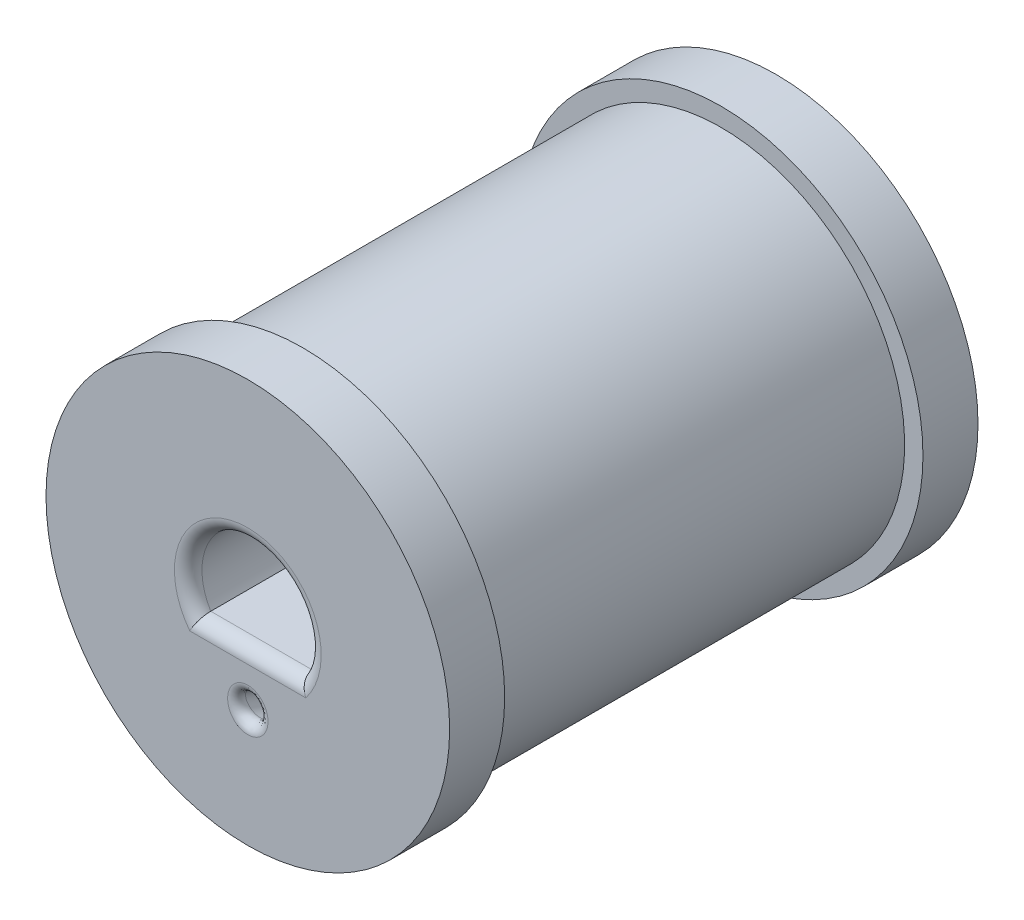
ISO-10303-21;
HEADER;
FILE_DESCRIPTION(('STEP AP214'),'2;1');
FILE_NAME('part.step','',(''),(''),'','','');
FILE_SCHEMA(('AUTOMOTIVE_DESIGN { 1 0 10303 214 1 1 1 1 }'));
ENDSEC;
DATA;
#1=APPLICATION_CONTEXT('core data for automotive mechanical design processes');
#2=APPLICATION_PROTOCOL_DEFINITION('international standard','automotive_design',2000,#1);
#3=PRODUCT_CONTEXT('',#1,'mechanical');
#4=PRODUCT('Part','Part','',(#3));
#5=PRODUCT_RELATED_PRODUCT_CATEGORY('part','',(#4));
#6=PRODUCT_DEFINITION_FORMATION('','',#4);
#7=PRODUCT_DEFINITION_CONTEXT('part definition',#1,'design');
#8=PRODUCT_DEFINITION('design','',#6,#7);
#9=PRODUCT_DEFINITION_SHAPE('','',#8);
#10=(LENGTH_UNIT() NAMED_UNIT(*) SI_UNIT(.MILLI.,.METRE.));
#11=(NAMED_UNIT(*) PLANE_ANGLE_UNIT() SI_UNIT($,.RADIAN.));
#12=(NAMED_UNIT(*) SI_UNIT($,.STERADIAN.) SOLID_ANGLE_UNIT());
#13=UNCERTAINTY_MEASURE_WITH_UNIT(LENGTH_MEASURE(1.E-05),#10,'distance_accuracy_value','');
#14=(GEOMETRIC_REPRESENTATION_CONTEXT(3) GLOBAL_UNCERTAINTY_ASSIGNED_CONTEXT((#13)) GLOBAL_UNIT_ASSIGNED_CONTEXT((#10,
#11,#12)) REPRESENTATION_CONTEXT('',''));
#15=CARTESIAN_POINT('',(0.,0.,0.));
#16=DIRECTION('',(0.,0.,1.));
#17=DIRECTION('',(1.,0.,0.));
#18=AXIS2_PLACEMENT_3D('',#15,#16,#17);
#19=CARTESIAN_POINT('',(1.96214168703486,-3.6,0.));
#20=DIRECTION('',(0.,1.,0.));
#21=DIRECTION('',(1.,0.,0.));
#22=AXIS2_PLACEMENT_3D('',#19,#20,#21);
#23=PLANE('',#22);
#24=DIRECTION('',(1.,0.,0.));
#25=VECTOR('',#24,1.);
#26=CARTESIAN_POINT('',(0.981070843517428,-3.6,1.));
#27=LINE('',#26,#25);
#28=CARTESIAN_POINT('',(-1.96214168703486,-3.6,1.));
#29=VERTEX_POINT('',#28);
#30=CARTESIAN_POINT('',(1.96214168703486,-3.6,1.));
#31=VERTEX_POINT('',#30);
#32=EDGE_CURVE('E143',#29,#31,#27,.T.);
#33=ORIENTED_EDGE('',*,*,#32,.F.);
#34=DIRECTION('',(0.,0.,1.));
#35=VECTOR('',#34,1.);
#36=CARTESIAN_POINT('',(-1.96214168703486,-3.6,0.));
#37=LINE('',#36,#35);
#38=CARTESIAN_POINT('',(-1.96214168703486,-3.6,19.5));
#39=VERTEX_POINT('',#38);
#40=EDGE_CURVE('E172',#29,#39,#37,.T.);
#41=ORIENTED_EDGE('',*,*,#40,.T.);
#42=DIRECTION('',(-1.,0.,0.));
#43=VECTOR('',#42,1.);
#44=CARTESIAN_POINT('',(0.,-3.6,19.5));
#45=LINE('',#44,#43);
#46=CARTESIAN_POINT('',(1.96214168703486,-3.6,19.5));
#47=VERTEX_POINT('',#46);
#48=EDGE_CURVE('E11',#47,#39,#45,.T.);
#49=ORIENTED_EDGE('',*,*,#48,.F.);
#50=DIRECTION('',(0.,0.,1.));
#51=VECTOR('',#50,1.);
#52=CARTESIAN_POINT('',(1.96214168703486,-3.6,0.));
#53=LINE('',#52,#51);
#54=EDGE_CURVE('E140',#31,#47,#53,.T.);
#55=ORIENTED_EDGE('',*,*,#54,.F.);
#56=EDGE_LOOP('',(#33,#41,#49,#55));
#57=FACE_BOUND('',#56,.T.);
#58=ADVANCED_FACE('F16',(#57),#23,.T.);
#59=CARTESIAN_POINT('',(0.,0.,21.5));
#60=DIRECTION('',(0.,0.,1.));
#61=DIRECTION('',(1.,0.,0.));
#62=AXIS2_PLACEMENT_3D('',#59,#60,#61);
#63=PLANE('',#62);
#64=DIRECTION('',(1.,0.,0.));
#65=VECTOR('',#64,1.);
#66=CARTESIAN_POINT('',(1.38496389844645,-1.7,21.5));
#67=LINE('',#66,#65);
#68=CARTESIAN_POINT('',(-2.76992779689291,-1.7,21.5));
#69=VERTEX_POINT('',#68);
#70=CARTESIAN_POINT('',(2.76992779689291,-1.7,21.5));
#71=VERTEX_POINT('',#70);
#72=EDGE_CURVE('E260',#69,#71,#67,.T.);
#73=ORIENTED_EDGE('',*,*,#72,.T.);
#74=CARTESIAN_POINT('',(0.,0.,21.5));
#75=DIRECTION('',(0.,0.,1.));
#76=DIRECTION('',(-1.,0.,0.));
#77=AXIS2_PLACEMENT_3D('',#74,#75,#76);
#78=CIRCLE('',#77,3.25);
#79=EDGE_CURVE('E27',#71,#69,#78,.T.);
#80=ORIENTED_EDGE('',*,*,#79,.T.);
#81=EDGE_LOOP('',(#73,#80));
#82=FACE_BOUND('',#81,.T.);
#83=ADVANCED_FACE('F734',(#82),#63,.T.);
#84=CARTESIAN_POINT('',(0.,0.,19.5));
#85=DIRECTION('',(0.,0.,1.));
#86=DIRECTION('',(1.,0.,0.));
#87=AXIS2_PLACEMENT_3D('',#84,#85,#86);
#88=PLANE('',#87);
#89=ORIENTED_EDGE('',*,*,#48,.T.);
#90=CARTESIAN_POINT('',(0.,0.,19.5));
#91=DIRECTION('',(0.,0.,-1.));
#92=DIRECTION('',(1.,0.,0.));
#93=AXIS2_PLACEMENT_3D('',#90,#91,#92);
#94=CIRCLE('',#93,4.1);
#95=EDGE_CURVE('E150',#39,#47,#94,.T.);
#96=ORIENTED_EDGE('',*,*,#95,.T.);
#97=EDGE_LOOP('',(#89,#96));
#98=FACE_BOUND('',#97,.T.);
#99=ADVANCED_FACE('F739',(#98),#88,.F.);
#100=CARTESIAN_POINT('',(0.,0.,21.5));
#101=DIRECTION('',(0.,0.,1.));
#102=DIRECTION('',(0.,1.,0.));
#103=AXIS2_PLACEMENT_3D('',#100,#101,#102);
#104=CYLINDRICAL_SURFACE('',#103,3.25);
#105=CARTESIAN_POINT('',(0.,0.,28.05));
#106=DIRECTION('',(0.,0.,-1.));
#107=DIRECTION('',(0.,1.,0.));
#108=AXIS2_PLACEMENT_3D('',#105,#106,#107);
#109=CIRCLE('',#108,3.25);
#110=CARTESIAN_POINT('',(-2.76992779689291,-1.7,28.05));
#111=VERTEX_POINT('',#110);
#112=CARTESIAN_POINT('',(2.76992779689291,-1.7,28.05));
#113=VERTEX_POINT('',#112);
#114=EDGE_CURVE('E250',#111,#113,#109,.T.);
#115=ORIENTED_EDGE('',*,*,#114,.F.);
#116=DIRECTION('',(0.,0.,1.));
#117=VECTOR('',#116,1.);
#118=CARTESIAN_POINT('',(-2.76992779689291,-1.7,21.5));
#119=LINE('',#118,#117);
#120=EDGE_CURVE('E264',#69,#111,#119,.T.);
#121=ORIENTED_EDGE('',*,*,#120,.F.);
#122=ORIENTED_EDGE('',*,*,#79,.F.);
#123=DIRECTION('',(0.,0.,1.));
#124=VECTOR('',#123,1.);
#125=CARTESIAN_POINT('',(2.76992779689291,-1.7,21.5));
#126=LINE('',#125,#124);
#127=EDGE_CURVE('E257',#71,#113,#126,.T.);
#128=ORIENTED_EDGE('',*,*,#127,.T.);
#129=EDGE_LOOP('',(#115,#121,#122,#128));
#130=FACE_BOUND('',#129,.T.);
#131=ADVANCED_FACE('F775',(#130),#104,.F.);
#132=CARTESIAN_POINT('',(0.,0.,25.8));
#133=DIRECTION('',(0.,0.,1.));
#134=DIRECTION('',(1.,0.,0.));
#135=AXIS2_PLACEMENT_3D('',#132,#133,#134);
#136=PLANE('',#135);
#137=CARTESIAN_POINT('',(0.,0.,25.8));
#138=DIRECTION('',(0.,0.,-1.));
#139=DIRECTION('',(1.,0.,0.));
#140=AXIS2_PLACEMENT_3D('',#137,#138,#139);
#141=CIRCLE('',#140,10.);
#142=CARTESIAN_POINT('',(-10.,0.,25.8));
#143=VERTEX_POINT('',#142);
#144=EDGE_CURVE('E201',#143,#143,#141,.T.);
#145=ORIENTED_EDGE('',*,*,#144,.F.);
#146=EDGE_LOOP('',(#145));
#147=FACE_BOUND('',#146,.T.);
#148=CARTESIAN_POINT('',(0.,0.,25.8));
#149=DIRECTION('',(0.,0.,-1.));
#150=DIRECTION('',(-1.,0.,0.));
#151=AXIS2_PLACEMENT_3D('',#148,#149,#150);
#152=CIRCLE('',#151,11.);
#153=CARTESIAN_POINT('',(11.,0.,25.8));
#154=VERTEX_POINT('',#153);
#155=EDGE_CURVE('E270',#154,#154,#152,.T.);
#156=ORIENTED_EDGE('',*,*,#155,.T.);
#157=EDGE_LOOP('',(#156));
#158=FACE_BOUND('',#157,.T.);
#159=ADVANCED_FACE('F754',(#147,#158),#136,.F.);
#160=CARTESIAN_POINT('',(0.,0.,28.8));
#161=DIRECTION('',(0.,0.,-1.));
#162=DIRECTION('',(-1.,0.,0.));
#163=AXIS2_PLACEMENT_3D('',#160,#161,#162);
#164=CYLINDRICAL_SURFACE('',#163,11.);
#165=ORIENTED_EDGE('',*,*,#155,.F.);
#166=DIRECTION('',(0.,0.,1.));
#167=VECTOR('',#166,1.);
#168=CARTESIAN_POINT('',(11.,0.,28.8));
#169=LINE('',#168,#167);
#170=CARTESIAN_POINT('',(11.,0.,28.8));
#171=VERTEX_POINT('',#170);
#172=EDGE_CURVE('E40',#154,#171,#169,.T.);
#173=ORIENTED_EDGE('',*,*,#172,.T.);
#174=CARTESIAN_POINT('',(0.,0.,28.8));
#175=DIRECTION('',(0.,0.,1.));
#176=DIRECTION('',(-1.,0.,0.));
#177=AXIS2_PLACEMENT_3D('',#174,#175,#176);
#178=CIRCLE('',#177,11.);
#179=EDGE_CURVE('E233',#171,#171,#178,.T.);
#180=ORIENTED_EDGE('',*,*,#179,.F.);
#181=ORIENTED_EDGE('',*,*,#172,.F.);
#182=EDGE_LOOP('',(#165,#173,#180,#181));
#183=FACE_BOUND('',#182,.T.);
#184=ADVANCED_FACE('F749',(#183),#164,.T.);
#185=CARTESIAN_POINT('',(0.,0.,3.));
#186=DIRECTION('',(0.,0.,-1.));
#187=DIRECTION('',(0.,-1.,0.));
#188=AXIS2_PLACEMENT_3D('',#185,#186,#187);
#189=PLANE('',#188);
#190=CARTESIAN_POINT('',(0.,0.,3.));
#191=DIRECTION('',(0.,0.,1.));
#192=DIRECTION('',(1.,0.,0.));
#193=AXIS2_PLACEMENT_3D('',#190,#191,#192);
#194=CIRCLE('',#193,10.);
#195=CARTESIAN_POINT('',(-10.,0.,3.));
#196=VERTEX_POINT('',#195);
#197=EDGE_CURVE('E200',#196,#196,#194,.T.);
#198=ORIENTED_EDGE('',*,*,#197,.F.);
#199=EDGE_LOOP('',(#198));
#200=FACE_BOUND('',#199,.T.);
#201=CARTESIAN_POINT('',(0.,0.,3.));
#202=DIRECTION('',(0.,0.,1.));
#203=DIRECTION('',(1.,0.,0.));
#204=AXIS2_PLACEMENT_3D('',#201,#202,#203);
#205=CIRCLE('',#204,11.);
#206=CARTESIAN_POINT('',(-11.,0.,3.));
#207=VERTEX_POINT('',#206);
#208=EDGE_CURVE('E267',#207,#207,#205,.T.);
#209=ORIENTED_EDGE('',*,*,#208,.T.);
#210=EDGE_LOOP('',(#209));
#211=FACE_BOUND('',#210,.T.);
#212=ADVANCED_FACE('F726',(#200,#211),#189,.F.);
#213=CARTESIAN_POINT('',(0.,0.,0.));
#214=DIRECTION('',(0.,0.,1.));
#215=DIRECTION('',(1.,0.,0.));
#216=AXIS2_PLACEMENT_3D('',#213,#214,#215);
#217=CYLINDRICAL_SURFACE('',#216,11.);
#218=ORIENTED_EDGE('',*,*,#208,.F.);
#219=DIRECTION('',(0.,0.,-1.));
#220=VECTOR('',#219,1.);
#221=CARTESIAN_POINT('',(-11.,0.,0.));
#222=LINE('',#221,#220);
#223=CARTESIAN_POINT('',(-11.,0.,0.));
#224=VERTEX_POINT('',#223);
#225=EDGE_CURVE('E50',#207,#224,#222,.T.);
#226=ORIENTED_EDGE('',*,*,#225,.T.);
#227=CARTESIAN_POINT('',(0.,0.,0.));
#228=DIRECTION('',(0.,0.,-1.));
#229=DIRECTION('',(1.,0.,0.));
#230=AXIS2_PLACEMENT_3D('',#227,#228,#229);
#231=CIRCLE('',#230,11.);
#232=EDGE_CURVE('E221',#224,#224,#231,.T.);
#233=ORIENTED_EDGE('',*,*,#232,.F.);
#234=ORIENTED_EDGE('',*,*,#225,.F.);
#235=EDGE_LOOP('',(#218,#226,#233,#234));
#236=FACE_BOUND('',#235,.T.);
#237=ADVANCED_FACE('F673',(#236),#217,.T.);
#238=CARTESIAN_POINT('',(2.76992779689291,-1.7,21.5));
#239=DIRECTION('',(0.,1.,0.));
#240=DIRECTION('',(1.,0.,0.));
#241=AXIS2_PLACEMENT_3D('',#238,#239,#240);
#242=PLANE('',#241);
#243=DIRECTION('',(-1.,0.,0.));
#244=VECTOR('',#243,1.);
#245=CARTESIAN_POINT('',(1.38496389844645,-1.7,28.05));
#246=LINE('',#245,#244);
#247=EDGE_CURVE('E213',#113,#111,#246,.T.);
#248=ORIENTED_EDGE('',*,*,#247,.F.);
#249=ORIENTED_EDGE('',*,*,#127,.F.);
#250=ORIENTED_EDGE('',*,*,#72,.F.);
#251=ORIENTED_EDGE('',*,*,#120,.T.);
#252=EDGE_LOOP('',(#248,#249,#250,#251));
#253=FACE_BOUND('',#252,.T.);
#254=ADVANCED_FACE('F348',(#253),#242,.T.);
#255=CARTESIAN_POINT('',(0.,0.,28.05));
#256=DIRECTION('',(0.,0.,-1.));
#257=DIRECTION('',(0.,1.,0.));
#258=AXIS2_PLACEMENT_3D('',#255,#256,#257);
#259=TOROIDAL_SURFACE('',#258,4.,0.75);
#260=ORIENTED_EDGE('',*,*,#114,.T.);
#261=CARTESIAN_POINT('',(3.16188235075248,-2.45,28.8));
#262=CARTESIAN_POINT('',(3.16124583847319,-2.44870156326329,28.8));
#263=CARTESIAN_POINT('',(3.16060917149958,-2.44740320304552,28.7999966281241));
#264=CARTESIAN_POINT('',(3.10686847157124,-2.33784247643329,28.7994276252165));
#265=CARTESIAN_POINT('',(3.05283087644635,-2.23053941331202,28.7754307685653));
#266=CARTESIAN_POINT('',(2.95399275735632,-2.03912506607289,28.6857175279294));
#267=CARTESIAN_POINT('',(2.90913458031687,-1.95456301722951,28.6229842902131));
#268=CARTESIAN_POINT('',(2.83869268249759,-1.82406510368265,28.4733665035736));
#269=CARTESIAN_POINT('',(2.81187907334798,-1.7754338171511,28.3916439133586));
#270=CARTESIAN_POINT('',(2.77826329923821,-1.71483832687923,28.220993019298));
#271=CARTESIAN_POINT('',(2.76992779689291,-1.7,28.1361960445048));
#272=CARTESIAN_POINT('',(2.76992779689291,-1.7,28.05));
#273=(BOUNDED_CURVE() B_SPLINE_CURVE(3,(#261,#262,#263,#264,#265,#266,#267,#268,#269,#270,#271,
#272),.UNSPECIFIED.,.F.,.F.) B_SPLINE_CURVE_WITH_KNOTS((4,2,2,2,2,4),(-0.000433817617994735,0.,
0.0361759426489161,0.070066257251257,0.0995583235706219,0.125566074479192),
.UNSPECIFIED.) CURVE() GEOMETRIC_REPRESENTATION_ITEM() RATIONAL_B_SPLINE_CURVE((1.,1.,1.,1.,1.,
1.,1.,1.,1.,1.,1.,1.)) REPRESENTATION_ITEM(''));
#274=CARTESIAN_POINT('',(3.16188235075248,-2.45,28.8));
#275=VERTEX_POINT('',#274);
#276=EDGE_CURVE('E185',#275,#113,#273,.T.);
#277=ORIENTED_EDGE('',*,*,#276,.F.);
#278=CARTESIAN_POINT('',(0.,0.,28.8));
#279=DIRECTION('',(0.,0.,1.));
#280=DIRECTION('',(0.,1.,0.));
#281=AXIS2_PLACEMENT_3D('',#278,#279,#280);
#282=CIRCLE('',#281,4.);
#283=CARTESIAN_POINT('',(-3.16188235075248,-2.45,28.8));
#284=VERTEX_POINT('',#283);
#285=EDGE_CURVE('E182',#275,#284,#282,.T.);
#286=ORIENTED_EDGE('',*,*,#285,.T.);
#287=CARTESIAN_POINT('',(-3.16188235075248,-2.45,28.8));
#288=CARTESIAN_POINT('',(-3.16124583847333,-2.44870156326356,28.8));
#289=CARTESIAN_POINT('',(-3.16060917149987,-2.44740320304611,28.7999966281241));
#290=CARTESIAN_POINT('',(-3.10686847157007,-2.33784247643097,28.7994276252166));
#291=CARTESIAN_POINT('',(-3.05283087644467,-2.23053941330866,28.7754307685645));
#292=CARTESIAN_POINT('',(-2.95399275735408,-2.03912506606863,28.6857175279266));
#293=CARTESIAN_POINT('',(-2.90913458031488,-1.95456301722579,28.6229842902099));
#294=CARTESIAN_POINT('',(-2.83869268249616,-1.82406510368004,28.4733665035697));
#295=CARTESIAN_POINT('',(-2.81187907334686,-1.77543381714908,28.3916439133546));
#296=CARTESIAN_POINT('',(-2.77826329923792,-1.71483832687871,28.2209930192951));
#297=CARTESIAN_POINT('',(-2.76992779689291,-1.7,28.1361960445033));
#298=CARTESIAN_POINT('',(-2.76992779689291,-1.7,28.05));
#299=(BOUNDED_CURVE() B_SPLINE_CURVE(3,(#287,#288,#289,#290,#291,#292,#293,#294,#295,#296,#297,
#298),.UNSPECIFIED.,.F.,.F.) B_SPLINE_CURVE_WITH_KNOTS((4,2,2,2,2,4),(-0.251269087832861,
-0.250835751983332,-0.214699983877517,-0.180847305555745,-0.151387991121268,-0.125409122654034),
.UNSPECIFIED.) CURVE() GEOMETRIC_REPRESENTATION_ITEM() RATIONAL_B_SPLINE_CURVE((1.,1.,1.,1.,1.,
1.,1.,1.,1.,1.,1.,1.)) REPRESENTATION_ITEM(''));
#300=EDGE_CURVE('E244',#284,#111,#299,.T.);
#301=ORIENTED_EDGE('',*,*,#300,.T.);
#302=EDGE_LOOP('',(#260,#277,#286,#301));
#303=FACE_BOUND('',#302,.T.);
#304=ADVANCED_FACE('F672',(#303),#259,.T.);
#305=CARTESIAN_POINT('',(1.38496389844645,-2.45,28.05));
#306=DIRECTION('',(-1.,0.,0.));
#307=DIRECTION('',(0.,0.707106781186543,0.707106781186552));
#308=AXIS2_PLACEMENT_3D('',#305,#306,#307);
#309=CYLINDRICAL_SURFACE('',#308,0.75);
#310=DIRECTION('',(1.,0.,0.));
#311=VECTOR('',#310,1.);
#312=CARTESIAN_POINT('',(1.38496389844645,-2.45,28.8));
#313=LINE('',#312,#311);
#314=EDGE_CURVE('E186',#284,#275,#313,.T.);
#315=ORIENTED_EDGE('',*,*,#314,.T.);
#316=ORIENTED_EDGE('',*,*,#276,.T.);
#317=ORIENTED_EDGE('',*,*,#247,.T.);
#318=ORIENTED_EDGE('',*,*,#300,.F.);
#319=EDGE_LOOP('',(#315,#316,#317,#318));
#320=FACE_BOUND('',#319,.T.);
#321=ADVANCED_FACE('F694',(#320),#309,.T.);
#322=CARTESIAN_POINT('',(0.,0.,28.8));
#323=DIRECTION('',(0.,0.,1.));
#324=DIRECTION('',(1.,0.,0.));
#325=AXIS2_PLACEMENT_3D('',#322,#323,#324);
#326=PLANE('',#325);
#327=CARTESIAN_POINT('',(0.,-4.59813140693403,28.8));
#328=DIRECTION('',(0.,0.,1.));
#329=DIRECTION('',(0.,1.,0.));
#330=AXIS2_PLACEMENT_3D('',#327,#328,#329);
#331=ELLIPSE('',#330,1.1705955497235,1.1);
#332=CARTESIAN_POINT('',(0.,-5.76872695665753,28.8));
#333=VERTEX_POINT('',#332);
#334=EDGE_CURVE('E237',#333,#333,#331,.T.);
#335=ORIENTED_EDGE('',*,*,#334,.F.);
#336=EDGE_LOOP('',(#335));
#337=FACE_BOUND('',#336,.T.);
#338=ORIENTED_EDGE('',*,*,#314,.F.);
#339=ORIENTED_EDGE('',*,*,#285,.F.);
#340=EDGE_LOOP('',(#338,#339));
#341=FACE_BOUND('',#340,.T.);
#342=ORIENTED_EDGE('',*,*,#179,.T.);
#343=EDGE_LOOP('',(#342));
#344=FACE_BOUND('',#343,.T.);
#345=ADVANCED_FACE('F300',(#337,#341,#344),#326,.T.);
#346=CARTESIAN_POINT('',(0.,-5.29888064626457,28.1289899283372));
#347=CARTESIAN_POINT('',(-0.0897597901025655,-5.29888064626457,28.1289899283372));
#348=CARTESIAN_POINT('',(-0.268601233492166,-5.2507339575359,28.140739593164));
#349=CARTESIAN_POINT('',(-0.559061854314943,-4.98400191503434,28.2058325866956));
#350=CARTESIAN_POINT('',(-0.669284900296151,-4.42071708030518,28.343295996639));
#351=CARTESIAN_POINT('',(-0.298049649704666,-3.87379784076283,28.476765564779));
#352=CARTESIAN_POINT('',(0.198231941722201,-3.8766212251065,28.4760765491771));
#353=CARTESIAN_POINT('',(0.484439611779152,-4.14676542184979,28.4101508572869));
#354=CARTESIAN_POINT('',(0.647349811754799,-4.53324502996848,28.3158347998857));
#355=CARTESIAN_POINT('',(0.536650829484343,-5.09789303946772,28.1780387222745));
#356=CARTESIAN_POINT('',(0.179519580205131,-5.29888064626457,28.1289899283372));
#357=CARTESIAN_POINT('',(0.,-5.29888064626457,28.1289899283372));
#358=CARTESIAN_POINT('',(0.,-5.26761247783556,28.2148985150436));
#359=CARTESIAN_POINT('',(-0.0847550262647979,-5.26761247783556,28.2148985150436));
#360=CARTESIAN_POINT('',(-0.253836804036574,-5.22449002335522,28.2263053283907));
#361=CARTESIAN_POINT('',(-0.541742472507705,-4.98035655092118,28.2888827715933));
#362=CARTESIAN_POINT('',(-0.679684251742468,-4.42582597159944,28.4149747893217));
#363=CARTESIAN_POINT('',(-0.311689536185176,-3.85255053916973,28.5306538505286));
#364=CARTESIAN_POINT('',(0.207062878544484,-3.85618322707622,28.5301449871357));
#365=CARTESIAN_POINT('',(0.496800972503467,-4.13848568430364,28.4729100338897));
#366=CARTESIAN_POINT('',(0.65228156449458,-4.53729664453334,28.389887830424));
#367=CARTESIAN_POINT('',(0.512989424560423,-5.09118716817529,28.2631755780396));
#368=CARTESIAN_POINT('',(0.169510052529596,-5.26761247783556,28.2148985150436));
#369=CARTESIAN_POINT('',(0.,-5.26761247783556,28.2148985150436));
#370=CARTESIAN_POINT('',(0.,-5.25363427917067,28.4037165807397));
#371=CARTESIAN_POINT('',(-0.0825306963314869,-5.25363427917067,28.4037165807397));
#372=CARTESIAN_POINT('',(-0.247346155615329,-5.21595860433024,28.4128139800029));
#373=CARTESIAN_POINT('',(-0.549036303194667,-4.99316151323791,28.4618671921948));
#374=CARTESIAN_POINT('',(-0.732675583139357,-4.42452557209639,28.5539586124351));
#375=CARTESIAN_POINT('',(-0.346944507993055,-3.79038901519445,28.6311780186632));
#376=CARTESIAN_POINT('',(0.230250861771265,-3.79545756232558,28.6309690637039));
#377=CARTESIAN_POINT('',(0.541325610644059,-4.10632794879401,28.5926164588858));
#378=CARTESIAN_POINT('',(0.696521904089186,-4.53988465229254,28.5357513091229));
#379=CARTESIAN_POINT('',(0.509499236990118,-5.10496314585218,28.4428801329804));
#380=CARTESIAN_POINT('',(0.165061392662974,-5.25363427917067,28.4037165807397));
#381=CARTESIAN_POINT('',(0.,-5.25363427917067,28.4037165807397));
#382=CARTESIAN_POINT('',(0.,-5.40487505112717,28.7002423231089));
#383=CARTESIAN_POINT('',(-0.10662926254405,-5.40487505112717,28.7002423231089));
#384=CARTESIAN_POINT('',(-0.319392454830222,-5.35762809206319,28.7029761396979));
#385=CARTESIAN_POINT('',(-0.702649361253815,-5.07955109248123,28.7175317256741));
#386=CARTESIAN_POINT('',(-0.92065230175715,-4.38495246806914,28.7427599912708));
#387=CARTESIAN_POINT('',(-0.430616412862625,-3.62652153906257,28.7617503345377));
#388=CARTESIAN_POINT('',(0.285966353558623,-3.63248017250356,28.7617444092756));
#389=CARTESIAN_POINT('',(0.677263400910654,-4.00435998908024,28.7522479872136));
#390=CARTESIAN_POINT('',(0.877947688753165,-4.52565688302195,28.7378223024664));
#391=CARTESIAN_POINT('',(0.655544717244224,-5.21659997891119,28.712229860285));
#392=CARTESIAN_POINT('',(0.2132585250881,-5.40487505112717,28.7002423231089));
#393=CARTESIAN_POINT('',(0.,-5.40487505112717,28.7002423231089));
#394=CARTESIAN_POINT('',(0.,-5.63159394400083,28.8));
#395=CARTESIAN_POINT('',(-0.142665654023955,-5.63159394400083,28.8));
#396=CARTESIAN_POINT('',(-0.427170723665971,-5.56368160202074,28.8000478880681));
#397=CARTESIAN_POINT('',(-0.903572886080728,-5.18143578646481,28.7999815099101));
#398=CARTESIAN_POINT('',(-1.11199503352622,-4.33306675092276,28.7999753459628));
#399=CARTESIAN_POINT('',(-0.502984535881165,-3.47760688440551,28.7999276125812));
#400=CARTESIAN_POINT('',(0.334380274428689,-3.48279685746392,28.799947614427));
#401=CARTESIAN_POINT('',(0.808969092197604,-3.9042911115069,28.7999907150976));
#402=CARTESIAN_POINT('',(1.07076366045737,-4.50332426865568,28.7999422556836));
#403=CARTESIAN_POINT('',(0.860207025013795,-5.35158076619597,28.8000916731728));
#404=CARTESIAN_POINT('',(0.285331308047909,-5.63159394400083,28.8));
#405=CARTESIAN_POINT('',(0.,-5.63159394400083,28.8));
#406=CARTESIAN_POINT('',(0.,-5.76872695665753,28.8));
#407=CARTESIAN_POINT('',(-0.164559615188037,-5.76872695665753,28.8));
#408=CARTESIAN_POINT('',(-0.492435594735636,-5.68829832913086,28.8));
#409=CARTESIAN_POINT('',(-1.02494673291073,-5.24272475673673,28.8));
#410=CARTESIAN_POINT('',(-1.22702231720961,-4.30176230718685,28.8));
#411=CARTESIAN_POINT('',(-0.546424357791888,-3.38813844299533,28.8));
#412=CARTESIAN_POINT('',(0.363425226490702,-3.39285488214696,28.8));
#413=CARTESIAN_POINT('',(0.888139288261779,-3.8441284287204,28.8));
#414=CARTESIAN_POINT('',(1.18680798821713,-4.48973927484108,28.8));
#415=CARTESIAN_POINT('',(0.983859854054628,-5.43297889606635,28.8));
#416=CARTESIAN_POINT('',(0.329119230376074,-5.76872695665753,28.8));
#417=CARTESIAN_POINT('',(0.,-5.76872695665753,28.8));
#418=(BOUNDED_SURFACE() B_SPLINE_SURFACE(3,3,((#346,#347,#348,#349,#350,#351,#352,#353,#354,
#355,#356,#357),(#358,#359,#360,#361,#362,#363,#364,#365,#366,#367,#368,#369),(#370,#371,#372,
#373,#374,#375,#376,#377,#378,#379,#380,#381),(#382,#383,#384,#385,#386,#387,#388,#389,#390,
#391,#392,#393),(#394,#395,#396,#397,#398,#399,#400,#401,#402,#403,#404,#405),(#406,#407,#408,
#409,#410,#411,#412,#413,#414,#415,#416,#417)),.UNSPECIFIED.,.F.,.T.,
.F.) B_SPLINE_SURFACE_WITH_KNOTS((4,1,1,4),(4,1,1,1,1,1,1,1,1,4),(0.,0.285714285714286,
0.571428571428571,1.),(-3.14159265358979,-2.69279370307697,-2.24399475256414,-1.34639685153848,
-0.448798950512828,0.448798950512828,0.897597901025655,1.34639685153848,2.24399475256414,
3.14159265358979),.UNSPECIFIED.) GEOMETRIC_REPRESENTATION_ITEM() RATIONAL_B_SPLINE_SURFACE(((1.,
1.,1.,1.,1.,1.,1.,1.,1.,1.,1.,1.),(1.,1.,1.,1.,1.,1.,1.,1.,1.,1.,1.,1.),(1.,1.,1.,1.,1.,1.,1.,
1.,1.,1.,1.,1.),(1.,1.,1.,1.,1.,1.,1.,1.,1.,1.,1.,1.),(1.,1.,1.,1.,1.,1.,1.,1.,1.,1.,1.,1.),(1.,
1.,1.,1.,1.,1.,1.,1.,1.,1.,1.,1.))) REPRESENTATION_ITEM('') SURFACE());
#419=CARTESIAN_POINT('',(0.,-5.76872695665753,28.8));
#420=CARTESIAN_POINT('',(0.,-5.63159394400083,28.8));
#421=CARTESIAN_POINT('',(0.,-5.40487505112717,28.7002423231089));
#422=CARTESIAN_POINT('',(0.,-5.25363427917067,28.4037165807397));
#423=CARTESIAN_POINT('',(0.,-5.26761247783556,28.2148985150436));
#424=CARTESIAN_POINT('',(0.,-5.29888064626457,28.1289899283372));
#425=(BOUNDED_CURVE() B_SPLINE_CURVE(3,(#419,#420,#421,#422,#423,#424),.UNSPECIFIED.,.F.,
.F.) B_SPLINE_CURVE_WITH_KNOTS((4,1,1,4),(0.,0.428571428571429,0.714285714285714,1.),
.UNSPECIFIED.) CURVE() GEOMETRIC_REPRESENTATION_ITEM() RATIONAL_B_SPLINE_CURVE((1.,1.,1.,1.,1.,1.)) REPRESENTATION_ITEM(''));
#426=CARTESIAN_POINT('',(0.,-5.29888064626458,28.1289899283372));
#427=VERTEX_POINT('',#426);
#428=EDGE_CURVE('E232',#333,#427,#425,.T.);
#429=CARTESIAN_POINT('',(0.,-5.29888064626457,28.1289899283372));
#430=CARTESIAN_POINT('',(-0.0897597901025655,-5.29888064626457,28.1289899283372));
#431=CARTESIAN_POINT('',(-0.268601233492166,-5.2507339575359,28.140739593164));
#432=CARTESIAN_POINT('',(-0.559061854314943,-4.98400191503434,28.2058325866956));
#433=CARTESIAN_POINT('',(-0.669284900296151,-4.42071708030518,28.343295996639));
#434=CARTESIAN_POINT('',(-0.298049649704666,-3.87379784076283,28.476765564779));
#435=CARTESIAN_POINT('',(0.198231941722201,-3.8766212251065,28.4760765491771));
#436=CARTESIAN_POINT('',(0.484439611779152,-4.14676542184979,28.4101508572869));
#437=CARTESIAN_POINT('',(0.647349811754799,-4.53324502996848,28.3158347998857));
#438=CARTESIAN_POINT('',(0.536650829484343,-5.09789303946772,28.1780387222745));
#439=CARTESIAN_POINT('',(0.179519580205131,-5.29888064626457,28.1289899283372));
#440=CARTESIAN_POINT('',(0.,-5.29888064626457,28.1289899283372));
#441=(BOUNDED_CURVE() B_SPLINE_CURVE(3,(#429,#430,#431,#432,#433,#434,#435,#436,#437,#438,#439,
#440),.UNSPECIFIED.,.T.,.F.) B_SPLINE_CURVE_WITH_KNOTS((4,1,1,1,1,1,1,1,1,4),(-3.14159265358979,
-2.69279370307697,-2.24399475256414,-1.34639685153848,-0.448798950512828,0.448798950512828,
0.897597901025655,1.34639685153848,2.24399475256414,3.14159265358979),
.UNSPECIFIED.) CURVE() GEOMETRIC_REPRESENTATION_ITEM() RATIONAL_B_SPLINE_CURVE((1.,1.,1.,1.,1.,
1.,1.,1.,1.,1.,1.,1.)) REPRESENTATION_ITEM(''));
#442=CARTESIAN_POINT('',(0.6,-4.59813140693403,28.3));
#443=VERTEX_POINT('',#442);
#444=EDGE_CURVE('E416',#427,#443,#441,.T.);
#445=CARTESIAN_POINT('',(0.,-5.29888064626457,28.1289899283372));
#446=CARTESIAN_POINT('',(-0.0897597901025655,-5.29888064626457,28.1289899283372));
#447=CARTESIAN_POINT('',(-0.268601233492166,-5.2507339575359,28.140739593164));
#448=CARTESIAN_POINT('',(-0.559061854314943,-4.98400191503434,28.2058325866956));
#449=CARTESIAN_POINT('',(-0.669284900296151,-4.42071708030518,28.343295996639));
#450=CARTESIAN_POINT('',(-0.298049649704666,-3.87379784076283,28.476765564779));
#451=CARTESIAN_POINT('',(0.198231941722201,-3.8766212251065,28.4760765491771));
#452=CARTESIAN_POINT('',(0.484439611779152,-4.14676542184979,28.4101508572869));
#453=CARTESIAN_POINT('',(0.647349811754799,-4.53324502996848,28.3158347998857));
#454=CARTESIAN_POINT('',(0.536650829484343,-5.09789303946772,28.1780387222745));
#455=CARTESIAN_POINT('',(0.179519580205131,-5.29888064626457,28.1289899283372));
#456=CARTESIAN_POINT('',(0.,-5.29888064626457,28.1289899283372));
#457=(BOUNDED_CURVE() B_SPLINE_CURVE(3,(#445,#446,#447,#448,#449,#450,#451,#452,#453,#454,#455,
#456),.UNSPECIFIED.,.T.,.F.) B_SPLINE_CURVE_WITH_KNOTS((4,1,1,1,1,1,1,1,1,4),(-3.14159265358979,
-2.69279370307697,-2.24399475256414,-1.34639685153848,-0.448798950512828,0.448798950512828,
0.897597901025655,1.34639685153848,2.24399475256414,3.14159265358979),
.UNSPECIFIED.) CURVE() GEOMETRIC_REPRESENTATION_ITEM() RATIONAL_B_SPLINE_CURVE((1.,1.,1.,1.,1.,
1.,1.,1.,1.,1.,1.,1.)) REPRESENTATION_ITEM(''));
#458=EDGE_CURVE('E330',#443,#427,#457,.T.);
#459=CARTESIAN_POINT('',(0.,-5.29888064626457,28.1289899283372));
#460=CARTESIAN_POINT('',(-0.0897597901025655,-5.29888064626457,28.1289899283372));
#461=CARTESIAN_POINT('',(-0.268601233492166,-5.2507339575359,28.140739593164));
#462=CARTESIAN_POINT('',(-0.559061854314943,-4.98400191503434,28.2058325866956));
#463=CARTESIAN_POINT('',(-0.669284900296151,-4.42071708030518,28.343295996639));
#464=CARTESIAN_POINT('',(-0.298049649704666,-3.87379784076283,28.476765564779));
#465=CARTESIAN_POINT('',(0.198231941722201,-3.8766212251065,28.4760765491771));
#466=CARTESIAN_POINT('',(0.484439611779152,-4.14676542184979,28.4101508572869));
#467=CARTESIAN_POINT('',(0.647349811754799,-4.53324502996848,28.3158347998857));
#468=CARTESIAN_POINT('',(0.536650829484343,-5.09789303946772,28.1780387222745));
#469=CARTESIAN_POINT('',(0.179519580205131,-5.29888064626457,28.1289899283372));
#470=CARTESIAN_POINT('',(0.,-5.29888064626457,28.1289899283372));
#471=CARTESIAN_POINT('',(0.,-5.26761247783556,28.2148985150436));
#472=CARTESIAN_POINT('',(-0.0847550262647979,-5.26761247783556,28.2148985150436));
#473=CARTESIAN_POINT('',(-0.253836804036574,-5.22449002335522,28.2263053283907));
#474=CARTESIAN_POINT('',(-0.541742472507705,-4.98035655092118,28.2888827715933));
#475=CARTESIAN_POINT('',(-0.679684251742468,-4.42582597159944,28.4149747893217));
#476=CARTESIAN_POINT('',(-0.311689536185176,-3.85255053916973,28.5306538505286));
#477=CARTESIAN_POINT('',(0.207062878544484,-3.85618322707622,28.5301449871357));
#478=CARTESIAN_POINT('',(0.496800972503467,-4.13848568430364,28.4729100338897));
#479=CARTESIAN_POINT('',(0.65228156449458,-4.53729664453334,28.389887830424));
#480=CARTESIAN_POINT('',(0.512989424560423,-5.09118716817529,28.2631755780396));
#481=CARTESIAN_POINT('',(0.169510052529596,-5.26761247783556,28.2148985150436));
#482=CARTESIAN_POINT('',(0.,-5.26761247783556,28.2148985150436));
#483=CARTESIAN_POINT('',(0.,-5.25363427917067,28.4037165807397));
#484=CARTESIAN_POINT('',(-0.0825306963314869,-5.25363427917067,28.4037165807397));
#485=CARTESIAN_POINT('',(-0.247346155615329,-5.21595860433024,28.4128139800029));
#486=CARTESIAN_POINT('',(-0.549036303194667,-4.99316151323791,28.4618671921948));
#487=CARTESIAN_POINT('',(-0.732675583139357,-4.42452557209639,28.5539586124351));
#488=CARTESIAN_POINT('',(-0.346944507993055,-3.79038901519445,28.6311780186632));
#489=CARTESIAN_POINT('',(0.230250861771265,-3.79545756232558,28.6309690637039));
#490=CARTESIAN_POINT('',(0.541325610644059,-4.10632794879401,28.5926164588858));
#491=CARTESIAN_POINT('',(0.696521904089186,-4.53988465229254,28.5357513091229));
#492=CARTESIAN_POINT('',(0.509499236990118,-5.10496314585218,28.4428801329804));
#493=CARTESIAN_POINT('',(0.165061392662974,-5.25363427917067,28.4037165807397));
#494=CARTESIAN_POINT('',(0.,-5.25363427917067,28.4037165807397));
#495=CARTESIAN_POINT('',(0.,-5.40487505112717,28.7002423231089));
#496=CARTESIAN_POINT('',(-0.10662926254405,-5.40487505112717,28.7002423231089));
#497=CARTESIAN_POINT('',(-0.319392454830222,-5.35762809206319,28.7029761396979));
#498=CARTESIAN_POINT('',(-0.702649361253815,-5.07955109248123,28.7175317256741));
#499=CARTESIAN_POINT('',(-0.92065230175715,-4.38495246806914,28.7427599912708));
#500=CARTESIAN_POINT('',(-0.430616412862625,-3.62652153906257,28.7617503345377));
#501=CARTESIAN_POINT('',(0.285966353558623,-3.63248017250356,28.7617444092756));
#502=CARTESIAN_POINT('',(0.677263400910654,-4.00435998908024,28.7522479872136));
#503=CARTESIAN_POINT('',(0.877947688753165,-4.52565688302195,28.7378223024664));
#504=CARTESIAN_POINT('',(0.655544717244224,-5.21659997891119,28.712229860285));
#505=CARTESIAN_POINT('',(0.2132585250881,-5.40487505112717,28.7002423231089));
#506=CARTESIAN_POINT('',(0.,-5.40487505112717,28.7002423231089));
#507=CARTESIAN_POINT('',(0.,-5.63159394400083,28.8));
#508=CARTESIAN_POINT('',(-0.142665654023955,-5.63159394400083,28.8));
#509=CARTESIAN_POINT('',(-0.427170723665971,-5.56368160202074,28.8000478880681));
#510=CARTESIAN_POINT('',(-0.903572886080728,-5.18143578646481,28.7999815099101));
#511=CARTESIAN_POINT('',(-1.11199503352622,-4.33306675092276,28.7999753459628));
#512=CARTESIAN_POINT('',(-0.502984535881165,-3.47760688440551,28.7999276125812));
#513=CARTESIAN_POINT('',(0.334380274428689,-3.48279685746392,28.799947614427));
#514=CARTESIAN_POINT('',(0.808969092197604,-3.9042911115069,28.7999907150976));
#515=CARTESIAN_POINT('',(1.07076366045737,-4.50332426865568,28.7999422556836));
#516=CARTESIAN_POINT('',(0.860207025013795,-5.35158076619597,28.8000916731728));
#517=CARTESIAN_POINT('',(0.285331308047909,-5.63159394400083,28.8));
#518=CARTESIAN_POINT('',(0.,-5.63159394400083,28.8));
#519=CARTESIAN_POINT('',(0.,-5.76872695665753,28.8));
#520=CARTESIAN_POINT('',(-0.164559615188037,-5.76872695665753,28.8));
#521=CARTESIAN_POINT('',(-0.492435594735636,-5.68829832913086,28.8));
#522=CARTESIAN_POINT('',(-1.02494673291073,-5.24272475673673,28.8));
#523=CARTESIAN_POINT('',(-1.22702231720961,-4.30176230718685,28.8));
#524=CARTESIAN_POINT('',(-0.546424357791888,-3.38813844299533,28.8));
#525=CARTESIAN_POINT('',(0.363425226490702,-3.39285488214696,28.8));
#526=CARTESIAN_POINT('',(0.888139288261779,-3.8441284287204,28.8));
#527=CARTESIAN_POINT('',(1.18680798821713,-4.48973927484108,28.8));
#528=CARTESIAN_POINT('',(0.983859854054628,-5.43297889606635,28.8));
#529=CARTESIAN_POINT('',(0.329119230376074,-5.76872695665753,28.8));
#530=CARTESIAN_POINT('',(0.,-5.76872695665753,28.8));
#531=CARTESIAN_POINT('',(0.,-5.76952689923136,28.8));
#532=CARTESIAN_POINT('',(-0.164687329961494,-5.76952689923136,28.8));
#533=CARTESIAN_POINT('',(-0.492816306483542,-5.689025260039,28.7999997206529));
#534=CARTESIAN_POINT('',(-1.02565474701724,-5.24308227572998,28.8000001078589));
#535=CARTESIAN_POINT('',(-1.22769330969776,-4.30157969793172,28.8000001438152));
#536=CARTESIAN_POINT('',(-0.546677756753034,-3.38761654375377,28.8000004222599));
#537=CARTESIAN_POINT('',(0.36359465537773,-3.39233022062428,28.8000003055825));
#538=CARTESIAN_POINT('',(0.888601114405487,-3.84377747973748,28.8000000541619));
#539=CARTESIAN_POINT('',(1.1874849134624,-4.48966002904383,28.8000003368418));
#540=CARTESIAN_POINT('',(0.984581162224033,-5.43345371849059,28.7999994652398));
#541=CARTESIAN_POINT('',(0.329374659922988,-5.76952689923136,28.8));
#542=CARTESIAN_POINT('',(0.,-5.76952689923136,28.8));
#543=CARTESIAN_POINT('',(0.,-5.77032684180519,28.8));
#544=CARTESIAN_POINT('',(-0.164815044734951,-5.77032684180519,28.8));
#545=CARTESIAN_POINT('',(-0.493197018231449,-5.68975219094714,28.7999994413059));
#546=CARTESIAN_POINT('',(-1.02636276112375,-5.24343979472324,28.8000002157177));
#547=CARTESIAN_POINT('',(-1.22836430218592,-4.3013970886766,28.8000002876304));
#548=CARTESIAN_POINT('',(-0.54693115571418,-3.38709464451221,28.8000008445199));
#549=CARTESIAN_POINT('',(0.363764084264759,-3.3918055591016,28.800000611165));
#550=CARTESIAN_POINT('',(0.889062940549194,-3.84342653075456,28.8000001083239));
#551=CARTESIAN_POINT('',(1.18816183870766,-4.48958078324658,28.8000006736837));
#552=CARTESIAN_POINT('',(0.985302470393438,-5.43392854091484,28.7999989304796));
#553=CARTESIAN_POINT('',(0.329630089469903,-5.77032684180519,28.8));
#554=CARTESIAN_POINT('',(0.,-5.77032684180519,28.8));
#555=CARTESIAN_POINT('',(0.,-5.77112678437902,28.8));
#556=CARTESIAN_POINT('',(-0.164942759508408,-5.77112678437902,28.8));
#557=CARTESIAN_POINT('',(-0.493577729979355,-5.69047912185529,28.7999991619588));
#558=CARTESIAN_POINT('',(-1.02707077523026,-5.24379731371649,28.8000003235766));
#559=CARTESIAN_POINT('',(-1.22903529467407,-4.30121447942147,28.8000004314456));
#560=CARTESIAN_POINT('',(-0.547184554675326,-3.38657274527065,28.8000012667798));
#561=CARTESIAN_POINT('',(0.363933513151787,-3.39128089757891,28.8000009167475));
#562=CARTESIAN_POINT('',(0.889524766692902,-3.84307558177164,28.8000001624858));
#563=CARTESIAN_POINT('',(1.18883876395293,-4.48950153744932,28.8000010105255));
#564=CARTESIAN_POINT('',(0.986023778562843,-5.43440336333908,28.7999983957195));
#565=CARTESIAN_POINT('',(0.329885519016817,-5.77112678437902,28.8));
#566=CARTESIAN_POINT('',(0.,-5.77112678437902,28.8));
#567=(BOUNDED_SURFACE() B_SPLINE_SURFACE(3,3,((#459,#460,#461,#462,#463,#464,#465,#466,#467,
#468,#469,#470),(#471,#472,#473,#474,#475,#476,#477,#478,#479,#480,#481,#482),(#483,#484,#485,
#486,#487,#488,#489,#490,#491,#492,#493,#494),(#495,#496,#497,#498,#499,#500,#501,#502,#503,
#504,#505,#506),(#507,#508,#509,#510,#511,#512,#513,#514,#515,#516,#517,#518),(#519,#520,#521,
#522,#523,#524,#525,#526,#527,#528,#529,#530),(#531,#532,#533,#534,#535,#536,#537,#538,#539,
#540,#541,#542),(#543,#544,#545,#546,#547,#548,#549,#550,#551,#552,#553,#554),(#555,#556,#557,
#558,#559,#560,#561,#562,#563,#564,#565,#566)),.UNSPECIFIED.,.F.,.T.,
.F.) B_SPLINE_SURFACE_WITH_KNOTS((4,1,1,3,4),(4,1,1,1,1,1,1,1,1,4),(0.,0.285714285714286,
0.571428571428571,1.,1.0025),(-3.14159265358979,-2.69279370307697,-2.24399475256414,
-1.34639685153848,-0.448798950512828,0.448798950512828,0.897597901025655,1.34639685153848,
2.24399475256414,3.14159265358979),
.UNSPECIFIED.) GEOMETRIC_REPRESENTATION_ITEM() RATIONAL_B_SPLINE_SURFACE(((1.,1.,1.,1.,1.,1.,1.,
1.,1.,1.,1.,1.),(1.,1.,1.,1.,1.,1.,1.,1.,1.,1.,1.,1.),(1.,1.,1.,1.,1.,1.,1.,1.,1.,1.,1.,1.),(1.,
1.,1.,1.,1.,1.,1.,1.,1.,1.,1.,1.),(1.,1.,1.,1.,1.,1.,1.,1.,1.,1.,1.,1.),(1.,1.,1.,1.,1.,1.,1.,
1.,1.,1.,1.,1.),(1.,1.,1.,1.,1.,1.,1.,1.,1.,1.,1.,1.),(1.,1.,1.,1.,1.,1.,1.,1.,1.,1.,1.,1.),(1.,
1.,1.,1.,1.,1.,1.,1.,1.,1.,1.,1.))) REPRESENTATION_ITEM('') SURFACE());
#568=ORIENTED_EDGE('',*,*,#428,.T.);
#569=ORIENTED_EDGE('',*,*,#444,.T.);
#570=ORIENTED_EDGE('',*,*,#458,.T.);
#571=ORIENTED_EDGE('',*,*,#428,.F.);
#572=ORIENTED_EDGE('',*,*,#334,.T.);
#573=EDGE_LOOP('',(#568,#569,#570,#571,#572));
#574=FACE_BOUND('',#573,.T.);
#575=ADVANCED_FACE('F287',(#574),#567,.F.);
#576=CARTESIAN_POINT('',(0.,0.,0.));
#577=DIRECTION('',(0.,0.,1.));
#578=DIRECTION('',(1.,0.,0.));
#579=AXIS2_PLACEMENT_3D('',#576,#577,#578);
#580=CYLINDRICAL_SURFACE('',#579,10.);
#581=CARTESIAN_POINT('',(0.834026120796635,-9.96515932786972,13.5151092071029));
#582=CARTESIAN_POINT('',(0.888972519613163,-9.96056063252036,14.0421099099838));
#583=CARTESIAN_POINT('',(0.886768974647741,-9.96084115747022,14.8401701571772));
#584=CARTESIAN_POINT('',(0.702958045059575,-9.97586642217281,15.7541101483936));
#585=CARTESIAN_POINT('',(0.52557991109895,-9.98654792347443,16.1859968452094));
#586=CARTESIAN_POINT('',(0.380737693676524,-9.99299044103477,16.4107420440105));
#587=CARTESIAN_POINT('',(0.263340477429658,-9.99678573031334,16.5324112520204));
#588=CARTESIAN_POINT('',(0.147110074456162,-9.99904263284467,16.6017762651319));
#589=CARTESIAN_POINT('',(0.0155239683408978,-10.0004143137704,16.6428649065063));
#590=CARTESIAN_POINT('',(-0.158534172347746,-9.99933038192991,16.6108900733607));
#591=CARTESIAN_POINT('',(-0.31903816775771,-9.99520907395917,16.4833482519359));
#592=CARTESIAN_POINT('',(-0.481912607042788,-9.98884862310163,16.270358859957));
#593=CARTESIAN_POINT('',(-0.621806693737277,-9.98095356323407,15.9673800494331));
#594=CARTESIAN_POINT('',(-0.75343157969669,-9.97183506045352,15.5208251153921));
#595=CARTESIAN_POINT('',(-0.861707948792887,-9.9629262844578,14.866387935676));
#596=CARTESIAN_POINT('',(-0.88772326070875,-9.96052788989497,14.0710260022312));
#597=CARTESIAN_POINT('',(-0.812267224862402,-9.96714485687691,13.2141222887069));
#598=CARTESIAN_POINT('',(-0.672057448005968,-9.97795682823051,12.5622390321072));
#599=CARTESIAN_POINT('',(-0.50259646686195,-9.98769783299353,12.1292493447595));
#600=CARTESIAN_POINT('',(-0.383878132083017,-9.99276908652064,11.9274201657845));
#601=CARTESIAN_POINT('',(-0.300945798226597,-9.99554161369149,11.8221431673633));
#602=CARTESIAN_POINT('',(-0.206187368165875,-9.99809855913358,11.7276719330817));
#603=CARTESIAN_POINT('',(-0.0838851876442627,-10.0000575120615,11.6581974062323));
#604=CARTESIAN_POINT('',(0.0550738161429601,-10.0000311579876,11.6591501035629));
#605=CARTESIAN_POINT('',(0.183087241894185,-9.99864202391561,11.7083734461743));
#606=CARTESIAN_POINT('',(0.309581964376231,-9.99549622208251,11.8227176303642));
#607=CARTESIAN_POINT('',(0.461038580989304,-9.98977922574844,12.0431255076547));
#608=CARTESIAN_POINT('',(0.59430060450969,-9.98262060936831,12.3490639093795));
#609=CARTESIAN_POINT('',(0.744056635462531,-9.97267466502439,12.860203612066));
#610=CARTESIAN_POINT('',(0.806552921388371,-9.9674586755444,13.2516088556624));
#611=CARTESIAN_POINT('',(0.834026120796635,-9.96515932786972,13.5151092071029));
#612=(BOUNDED_CURVE() B_SPLINE_CURVE(3,(#581,#582,#583,#584,#585,#586,#587,#588,#589,#590,#591,
#592,#593,#594,#595,#596,#597,#598,#599,#600,#601,#602,#603,#604,#605,#606,#607,#608,#609,#610,
#611),.UNSPECIFIED.,.T.,.F.) B_SPLINE_CURVE_WITH_KNOTS((4,1,1,1,1,1,1,1,1,1,1,1,1,1,1,1,1,1,1,1,
1,1,1,1,1,1,1,1,4),(0.,0.106231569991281,0.159347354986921,0.185905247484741,0.199184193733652,
0.212463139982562,0.219102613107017,0.225742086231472,0.239021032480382,0.252299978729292,
0.265578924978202,0.292136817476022,0.318694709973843,0.358531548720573,0.424926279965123,
0.478042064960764,0.531157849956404,0.557715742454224,0.570994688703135,0.57763416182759,
0.584273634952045,0.597552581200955,0.60419205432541,0.610831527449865,0.624110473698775,
0.637389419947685,0.663947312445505,0.690505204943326,0.743620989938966),
.UNSPECIFIED.) CURVE() GEOMETRIC_REPRESENTATION_ITEM() RATIONAL_B_SPLINE_CURVE((1.,1.,1.,1.,1.,
1.,1.,1.,1.,1.,1.,1.,1.,1.,1.,1.,1.,1.,1.,1.,1.,1.,1.,1.,1.,1.,1.,1.,1.,1.,1.)) REPRESENTATION_ITEM(''));
#613=CARTESIAN_POINT('',(0.834026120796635,-9.96515932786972,13.5151092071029));
#614=VERTEX_POINT('',#613);
#615=EDGE_CURVE('E403',#614,#614,#612,.T.);
#616=ORIENTED_EDGE('',*,*,#615,.F.);
#617=EDGE_LOOP('',(#616));
#618=FACE_BOUND('',#617,.T.);
#619=ORIENTED_EDGE('',*,*,#144,.T.);
#620=DIRECTION('',(0.,0.,-1.));
#621=VECTOR('',#620,1.);
#622=CARTESIAN_POINT('',(-10.,0.,0.));
#623=LINE('',#622,#621);
#624=EDGE_CURVE('E197',#143,#196,#623,.T.);
#625=ORIENTED_EDGE('',*,*,#624,.T.);
#626=ORIENTED_EDGE('',*,*,#197,.T.);
#627=ORIENTED_EDGE('',*,*,#624,.F.);
#628=EDGE_LOOP('',(#619,#625,#626,#627));
#629=FACE_BOUND('',#628,.T.);
#630=ADVANCED_FACE('F299',(#618,#629),#580,.T.);
#631=CARTESIAN_POINT('',(0.,-4.09841753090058,29.6729525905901));
#632=DIRECTION('',(0.,-0.342020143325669,-0.939692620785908));
#633=DIRECTION('',(-1.,0.,0.));
#634=AXIS2_PLACEMENT_3D('',#631,#632,#633);
#635=CYLINDRICAL_SURFACE('',#634,0.6);
#636=ORIENTED_EDGE('',*,*,#444,.F.);
#637=ORIENTED_EDGE('',*,*,#458,.F.);
#638=DIRECTION('',(0.,-0.342020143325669,-0.939692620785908));
#639=VECTOR('',#638,1.);
#640=CARTESIAN_POINT('',(0.6,-4.09841753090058,29.6729525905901));
#641=LINE('',#640,#639);
#642=CARTESIAN_POINT('',(0.600649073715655,-9.71291977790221,14.2469498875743));
#643=VERTEX_POINT('',#642);
#644=EDGE_CURVE('E229',#443,#643,#641,.T.);
#645=ORIENTED_EDGE('',*,*,#644,.T.);
#646=CARTESIAN_POINT('',(0.574006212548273,-9.78442852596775,13.5400041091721));
#647=CARTESIAN_POINT('',(0.555098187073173,-9.8109962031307,13.2853576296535));
#648=CARTESIAN_POINT('',(0.512086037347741,-9.8517595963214,12.9069380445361));
#649=CARTESIAN_POINT('',(0.409018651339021,-9.90725518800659,12.4124675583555));
#650=CARTESIAN_POINT('',(0.317303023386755,-9.94134175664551,12.1163952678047));
#651=CARTESIAN_POINT('',(0.213065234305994,-9.96630279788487,11.9030436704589));
#652=CARTESIAN_POINT('',(0.126007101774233,-9.97938205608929,11.7923435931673));
#653=CARTESIAN_POINT('',(0.0379037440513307,-9.98503766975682,11.7446857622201));
#654=CARTESIAN_POINT('',(-0.0577327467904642,-9.98514674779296,11.7437634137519));
#655=CARTESIAN_POINT('',(-0.141905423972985,-9.97716555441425,11.8110281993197));
#656=CARTESIAN_POINT('',(-0.207121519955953,-9.96638986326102,11.9024847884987));
#657=CARTESIAN_POINT('',(-0.264198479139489,-9.95443712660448,12.0043952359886));
#658=CARTESIAN_POINT('',(-0.345904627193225,-9.93169836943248,12.1997478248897));
#659=CARTESIAN_POINT('',(-0.462533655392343,-9.88373803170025,12.6187381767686));
#660=CARTESIAN_POINT('',(-0.5590309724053,-9.81431320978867,13.2491897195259));
#661=CARTESIAN_POINT('',(-0.610962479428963,-9.72853617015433,14.0772213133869));
#662=CARTESIAN_POINT('',(-0.593057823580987,-9.65508363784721,14.8449975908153));
#663=CARTESIAN_POINT('',(-0.518538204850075,-9.59965144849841,15.4760976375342));
#664=CARTESIAN_POINT('',(-0.427949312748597,-9.5640212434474,15.9064483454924));
#665=CARTESIAN_POINT('',(-0.331669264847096,-9.54107988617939,16.1982754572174));
#666=CARTESIAN_POINT('',(-0.219573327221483,-9.52553736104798,16.4033506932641));
#667=CARTESIAN_POINT('',(-0.109108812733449,-9.51645581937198,16.5261245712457));
#668=CARTESIAN_POINT('',(0.0106841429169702,-9.51421567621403,16.5568994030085));
#669=CARTESIAN_POINT('',(0.101246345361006,-9.51710963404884,16.5173508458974));
#670=CARTESIAN_POINT('',(0.181240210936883,-9.52203755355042,16.4505803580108));
#671=CARTESIAN_POINT('',(0.262037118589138,-9.53079928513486,16.333446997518));
#672=CARTESIAN_POINT('',(0.361722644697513,-9.54739382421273,16.1170279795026));
#673=CARTESIAN_POINT('',(0.483800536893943,-9.58050933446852,15.7009848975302));
#674=CARTESIAN_POINT('',(0.610305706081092,-9.65605693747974,14.819874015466));
#675=CARTESIAN_POINT('',(0.611822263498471,-9.73129317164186,14.0492970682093));
#676=CARTESIAN_POINT('',(0.574006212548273,-9.78442852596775,13.5400041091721));
#677=(BOUNDED_CURVE() B_SPLINE_CURVE(3,(#646,#647,#648,#649,#650,#651,#652,#653,#654,#655,#656,
#657,#658,#659,#660,#661,#662,#663,#664,#665,#666,#667,#668,#669,#670,#671,#672,#673,#674,#675,
#676),.UNSPECIFIED.,.T.,.F.) B_SPLINE_CURVE_WITH_KNOTS((4,1,1,1,1,1,1,1,1,1,1,1,1,1,1,1,1,1,1,1,
1,1,1,1,1,1,1,1,4),(0.,0.0531157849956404,0.0796736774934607,0.106231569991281,
0.119510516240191,0.132789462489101,0.139428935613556,0.146068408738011,0.159347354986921,
0.165986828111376,0.172626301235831,0.185905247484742,0.212463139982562,0.265578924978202,
0.318694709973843,0.385089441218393,0.424926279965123,0.451484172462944,0.478042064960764,
0.491321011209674,0.504599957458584,0.517878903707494,0.524518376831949,0.531157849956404,
0.544436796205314,0.557715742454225,0.584273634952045,0.637389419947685,0.743620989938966),
.UNSPECIFIED.) CURVE() GEOMETRIC_REPRESENTATION_ITEM() RATIONAL_B_SPLINE_CURVE((1.,1.,1.,1.,1.,
1.,1.,1.,1.,1.,1.,1.,1.,1.,1.,1.,1.,1.,1.,1.,1.,1.,1.,1.,1.,1.,1.,1.,1.,1.,1.)) REPRESENTATION_ITEM(''));
#678=CARTESIAN_POINT('',(0.574006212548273,-9.78442852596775,13.5400041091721));
#679=VERTEX_POINT('',#678);
#680=EDGE_CURVE('E376',#679,#643,#677,.T.);
#681=ORIENTED_EDGE('',*,*,#680,.F.);
#682=CARTESIAN_POINT('',(0.574006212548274,-9.78442852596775,13.5400041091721));
#683=CARTESIAN_POINT('',(0.555098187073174,-9.8109962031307,13.2853576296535));
#684=CARTESIAN_POINT('',(0.512086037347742,-9.8517595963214,12.9069380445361));
#685=CARTESIAN_POINT('',(0.409018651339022,-9.90725518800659,12.4124675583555));
#686=CARTESIAN_POINT('',(0.317303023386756,-9.94134175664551,12.1163952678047));
#687=CARTESIAN_POINT('',(0.213065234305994,-9.96630279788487,11.9030436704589));
#688=CARTESIAN_POINT('',(0.126007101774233,-9.97938205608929,11.7923435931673));
#689=CARTESIAN_POINT('',(0.0379037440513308,-9.98503766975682,11.7446857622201));
#690=CARTESIAN_POINT('',(-0.0577327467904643,-9.98514674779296,11.7437634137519));
#691=CARTESIAN_POINT('',(-0.141905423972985,-9.97716555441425,11.8110281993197));
#692=CARTESIAN_POINT('',(-0.207121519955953,-9.96638986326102,11.9024847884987));
#693=CARTESIAN_POINT('',(-0.264198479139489,-9.95443712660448,12.0043952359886));
#694=CARTESIAN_POINT('',(-0.345904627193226,-9.93169836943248,12.1997478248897));
#695=CARTESIAN_POINT('',(-0.462533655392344,-9.88373803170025,12.6187381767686));
#696=CARTESIAN_POINT('',(-0.559030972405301,-9.81431320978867,13.2491897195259));
#697=CARTESIAN_POINT('',(-0.610962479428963,-9.72853617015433,14.0772213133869));
#698=CARTESIAN_POINT('',(-0.593057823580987,-9.65508363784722,14.8449975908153));
#699=CARTESIAN_POINT('',(-0.518538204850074,-9.59965144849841,15.4760976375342));
#700=CARTESIAN_POINT('',(-0.427949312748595,-9.5640212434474,15.9064483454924));
#701=CARTESIAN_POINT('',(-0.331669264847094,-9.54107988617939,16.1982754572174));
#702=CARTESIAN_POINT('',(-0.219573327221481,-9.52553736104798,16.4033506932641));
#703=CARTESIAN_POINT('',(-0.109108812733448,-9.51645581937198,16.5261245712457));
#704=CARTESIAN_POINT('',(0.01068414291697,-9.51421567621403,16.5568994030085));
#705=CARTESIAN_POINT('',(0.101246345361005,-9.51710963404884,16.5173508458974));
#706=CARTESIAN_POINT('',(0.181240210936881,-9.52203755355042,16.4505803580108));
#707=CARTESIAN_POINT('',(0.262037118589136,-9.53079928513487,16.333446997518));
#708=CARTESIAN_POINT('',(0.361722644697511,-9.54739382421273,16.1170279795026));
#709=CARTESIAN_POINT('',(0.483800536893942,-9.58050933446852,15.7009848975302));
#710=CARTESIAN_POINT('',(0.610305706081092,-9.65605693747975,14.819874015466));
#711=CARTESIAN_POINT('',(0.611822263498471,-9.73129317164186,14.0492970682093));
#712=CARTESIAN_POINT('',(0.574006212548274,-9.78442852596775,13.5400041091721));
#713=(BOUNDED_CURVE() B_SPLINE_CURVE(3,(#682,#683,#684,#685,#686,#687,#688,#689,#690,#691,#692,
#693,#694,#695,#696,#697,#698,#699,#700,#701,#702,#703,#704,#705,#706,#707,#708,#709,#710,#711,
#712),.UNSPECIFIED.,.T.,.F.) B_SPLINE_CURVE_WITH_KNOTS((4,1,1,1,1,1,1,1,1,1,1,1,1,1,1,1,1,1,1,1,
1,1,1,1,1,1,1,1,4),(0.,0.0531157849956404,0.0796736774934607,0.106231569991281,
0.119510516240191,0.132789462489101,0.139428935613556,0.146068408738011,0.159347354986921,
0.165986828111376,0.172626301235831,0.185905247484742,0.212463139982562,0.265578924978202,
0.318694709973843,0.385089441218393,0.424926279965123,0.451484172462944,0.478042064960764,
0.491321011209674,0.504599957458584,0.517878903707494,0.524518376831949,0.531157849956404,
0.544436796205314,0.557715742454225,0.584273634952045,0.637389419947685,0.743620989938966),
.UNSPECIFIED.) CURVE() GEOMETRIC_REPRESENTATION_ITEM() RATIONAL_B_SPLINE_CURVE((1.,1.,1.,1.,1.,
1.,1.,1.,1.,1.,1.,1.,1.,1.,1.,1.,1.,1.,1.,1.,1.,1.,1.,1.,1.,1.,1.,1.,1.,1.,1.)) REPRESENTATION_ITEM(''));
#714=EDGE_CURVE('E404',#643,#679,#713,.T.);
#715=ORIENTED_EDGE('',*,*,#714,.F.);
#716=ORIENTED_EDGE('',*,*,#644,.F.);
#717=EDGE_LOOP('',(#636,#637,#645,#681,#715,#716));
#718=FACE_BOUND('',#717,.T.);
#719=ADVANCED_FACE('F335',(#718),#635,.F.);
#720=CARTESIAN_POINT('',(0.574006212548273,-9.78442852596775,13.5400041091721));
#721=CARTESIAN_POINT('',(0.555098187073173,-9.8109962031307,13.2853576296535));
#722=CARTESIAN_POINT('',(0.512086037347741,-9.8517595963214,12.9069380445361));
#723=CARTESIAN_POINT('',(0.409018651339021,-9.90725518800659,12.4124675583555));
#724=CARTESIAN_POINT('',(0.317303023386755,-9.94134175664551,12.1163952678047));
#725=CARTESIAN_POINT('',(0.213065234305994,-9.96630279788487,11.9030436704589));
#726=CARTESIAN_POINT('',(0.126007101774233,-9.97938205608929,11.7923435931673));
#727=CARTESIAN_POINT('',(0.0379037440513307,-9.98503766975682,11.7446857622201));
#728=CARTESIAN_POINT('',(-0.0577327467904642,-9.98514674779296,11.7437634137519));
#729=CARTESIAN_POINT('',(-0.141905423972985,-9.97716555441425,11.8110281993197));
#730=CARTESIAN_POINT('',(-0.207121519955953,-9.96638986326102,11.9024847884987));
#731=CARTESIAN_POINT('',(-0.264198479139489,-9.95443712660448,12.0043952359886));
#732=CARTESIAN_POINT('',(-0.345904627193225,-9.93169836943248,12.1997478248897));
#733=CARTESIAN_POINT('',(-0.462533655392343,-9.88373803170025,12.6187381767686));
#734=CARTESIAN_POINT('',(-0.5590309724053,-9.81431320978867,13.2491897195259));
#735=CARTESIAN_POINT('',(-0.610962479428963,-9.72853617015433,14.0772213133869));
#736=CARTESIAN_POINT('',(-0.593057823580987,-9.65508363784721,14.8449975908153));
#737=CARTESIAN_POINT('',(-0.518538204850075,-9.59965144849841,15.4760976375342));
#738=CARTESIAN_POINT('',(-0.427949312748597,-9.5640212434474,15.9064483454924));
#739=CARTESIAN_POINT('',(-0.331669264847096,-9.54107988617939,16.1982754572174));
#740=CARTESIAN_POINT('',(-0.219573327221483,-9.52553736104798,16.4033506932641));
#741=CARTESIAN_POINT('',(-0.109108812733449,-9.51645581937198,16.5261245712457));
#742=CARTESIAN_POINT('',(0.0106841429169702,-9.51421567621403,16.5568994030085));
#743=CARTESIAN_POINT('',(0.101246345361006,-9.51710963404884,16.5173508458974));
#744=CARTESIAN_POINT('',(0.181240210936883,-9.52203755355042,16.4505803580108));
#745=CARTESIAN_POINT('',(0.262037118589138,-9.53079928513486,16.333446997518));
#746=CARTESIAN_POINT('',(0.361722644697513,-9.54739382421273,16.1170279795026));
#747=CARTESIAN_POINT('',(0.483800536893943,-9.58050933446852,15.7009848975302));
#748=CARTESIAN_POINT('',(0.610305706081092,-9.65605693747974,14.819874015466));
#749=CARTESIAN_POINT('',(0.611822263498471,-9.73129317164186,14.0492970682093));
#750=CARTESIAN_POINT('',(0.574006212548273,-9.78442852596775,13.5400041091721));
#751=CARTESIAN_POINT('',(0.582955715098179,-9.81595592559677,13.5393625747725));
#752=CARTESIAN_POINT('',(0.566534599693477,-9.83923019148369,13.2841832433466));
#753=CARTESIAN_POINT('',(0.526002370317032,-9.87448553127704,12.904560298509));
#754=CARTESIAN_POINT('',(0.422883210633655,-9.9219260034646,12.4080105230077));
#755=CARTESIAN_POINT('',(0.329242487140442,-9.95089049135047,12.1105162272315));
#756=CARTESIAN_POINT('',(0.221609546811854,-9.97203253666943,11.896069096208));
#757=CARTESIAN_POINT('',(0.131219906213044,-9.98309086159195,11.7847779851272));
#758=CARTESIAN_POINT('',(0.0394991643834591,-9.98786903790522,11.7368615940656));
#759=CARTESIAN_POINT('',(-0.0601328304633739,-9.98796126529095,11.7359343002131));
#760=CARTESIAN_POINT('',(-0.147725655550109,-9.98121914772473,11.8035628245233));
#761=CARTESIAN_POINT('',(-0.215363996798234,-9.97210439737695,11.895502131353));
#762=CARTESIAN_POINT('',(-0.274412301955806,-9.96198565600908,11.9979400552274));
#763=CARTESIAN_POINT('',(-0.358524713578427,-9.94270926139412,12.1942757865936));
#764=CARTESIAN_POINT('',(-0.477078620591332,-9.90190968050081,12.6151998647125));
#765=CARTESIAN_POINT('',(-0.571308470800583,-9.84229964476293,13.2480523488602));
#766=CARTESIAN_POINT('',(-0.614339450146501,-9.76701975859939,14.0776077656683));
#767=CARTESIAN_POINT('',(-0.583114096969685,-9.69998865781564,14.8445381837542));
#768=CARTESIAN_POINT('',(-0.493937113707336,-9.64504912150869,15.4705958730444));
#769=CARTESIAN_POINT('',(-0.392686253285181,-9.60643927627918,15.8935782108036));
#770=CARTESIAN_POINT('',(-0.289438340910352,-9.57830766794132,16.1750475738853));
#771=CARTESIAN_POINT('',(-0.178430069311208,-9.55610162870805,16.365541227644));
#772=CARTESIAN_POINT('',(-0.0783313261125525,-9.54055964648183,16.4698138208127));
#773=CARTESIAN_POINT('',(0.0070843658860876,-9.53586572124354,16.4911982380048));
#774=CARTESIAN_POINT('',(0.0748888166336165,-9.541561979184,16.4617204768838));
#775=CARTESIAN_POINT('',(0.142796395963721,-9.55025948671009,16.4063773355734));
#776=CARTESIAN_POINT('',(0.219552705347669,-9.56391243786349,16.3014714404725));
#777=CARTESIAN_POINT('',(0.321291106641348,-9.58640221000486,16.0974713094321));
#778=CARTESIAN_POINT('',(0.453599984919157,-9.62550736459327,15.6933617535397));
#779=CARTESIAN_POINT('',(0.601851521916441,-9.70211909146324,14.8205691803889));
#780=CARTESIAN_POINT('',(0.615797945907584,-9.76940739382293,14.0497212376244));
#781=CARTESIAN_POINT('',(0.582955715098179,-9.81595592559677,13.5393625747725));
#782=CARTESIAN_POINT('',(0.613355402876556,-9.87541808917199,13.5367781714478));
#783=CARTESIAN_POINT('',(0.599557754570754,-9.89138167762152,13.280269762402));
#784=CARTESIAN_POINT('',(0.560688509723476,-9.91537161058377,12.8981525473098));
#785=CARTESIAN_POINT('',(0.453871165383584,-9.94766463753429,12.3977951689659));
#786=CARTESIAN_POINT('',(0.354658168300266,-9.96741956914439,12.0978351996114));
#787=CARTESIAN_POINT('',(0.239276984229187,-9.98187679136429,11.8815444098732));
#788=CARTESIAN_POINT('',(0.14185162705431,-9.98945113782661,11.7692749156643));
#789=CARTESIAN_POINT('',(0.0427337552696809,-9.99272682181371,11.7209335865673));
#790=CARTESIAN_POINT('',(-0.065005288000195,-9.99278997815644,11.7199981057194));
#791=CARTESIAN_POINT('',(-0.159624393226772,-9.98816639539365,11.7882241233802));
#792=CARTESIAN_POINT('',(-0.232451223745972,-9.98192563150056,11.880965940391));
#793=CARTESIAN_POINT('',(-0.295869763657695,-9.97500182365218,11.984287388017));
#794=CARTESIAN_POINT('',(-0.385760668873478,-9.96183077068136,12.1822925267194));
#795=CARTESIAN_POINT('',(-0.510761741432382,-9.93398925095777,12.6066030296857));
#796=CARTESIAN_POINT('',(-0.605604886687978,-9.89348423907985,13.244069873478));
#797=CARTESIAN_POINT('',(-0.63865763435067,-9.84178496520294,14.0776569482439));
#798=CARTESIAN_POINT('',(-0.588016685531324,-9.79415348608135,14.8453933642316));
#799=CARTESIAN_POINT('',(-0.473380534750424,-9.75100221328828,15.4653014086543));
#800=CARTESIAN_POINT('',(-0.350814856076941,-9.71691444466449,15.8773937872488));
#801=CARTESIAN_POINT('',(-0.230694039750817,-9.6882300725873,16.1417337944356));
#802=CARTESIAN_POINT('',(-0.11525429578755,-9.66185247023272,16.3063894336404));
#803=CARTESIAN_POINT('',(-0.0272538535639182,-9.64048049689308,16.3762134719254));
#804=CARTESIAN_POINT('',(0.000983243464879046,-9.63312767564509,16.3796220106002));
#805=CARTESIAN_POINT('',(0.0317052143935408,-9.6417323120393,16.3693215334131));
#806=CARTESIAN_POINT('',(0.0821831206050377,-9.65396327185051,16.3353927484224));
#807=CARTESIAN_POINT('',(0.15644589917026,-9.67143514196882,16.2527872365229));
#808=CARTESIAN_POINT('',(0.267330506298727,-9.69686272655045,16.0704154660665));
#809=CARTESIAN_POINT('',(0.422878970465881,-9.73509199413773,15.6854679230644));
#810=CARTESIAN_POINT('',(0.610162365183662,-9.79684328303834,14.8231141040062));
#811=CARTESIAN_POINT('',(0.640950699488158,-9.84349091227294,14.0497949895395));
#812=CARTESIAN_POINT('',(0.613355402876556,-9.87541808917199,13.5367781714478));
#813=CARTESIAN_POINT('',(0.689453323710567,-9.94030518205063,13.5295944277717));
#814=CARTESIAN_POINT('',(0.673061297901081,-9.94684565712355,13.2705194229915));
#815=CARTESIAN_POINT('',(0.628221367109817,-9.95751695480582,12.8846389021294));
#816=CARTESIAN_POINT('',(0.507467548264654,-9.9734502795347,12.379523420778));
#817=CARTESIAN_POINT('',(0.396053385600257,-9.98379169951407,12.0767757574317));
#818=CARTESIAN_POINT('',(0.266985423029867,-9.99163388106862,11.858508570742));
#819=CARTESIAN_POINT('',(0.158213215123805,-9.99582956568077,11.7452233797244));
#820=CARTESIAN_POINT('',(0.0476574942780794,-9.99766092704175,11.6964467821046));
#821=CARTESIAN_POINT('',(-0.0724846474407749,-9.99769597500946,11.6955028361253));
#822=CARTESIAN_POINT('',(-0.17803770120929,-9.99511260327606,11.7643421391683));
#823=CARTESIAN_POINT('',(-0.259377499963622,-9.99167605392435,11.8579249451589));
#824=CARTESIAN_POINT('',(-0.330270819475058,-9.98790056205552,11.9621871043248));
#825=CARTESIAN_POINT('',(-0.43093068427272,-9.98083659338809,12.1620107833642));
#826=CARTESIAN_POINT('',(-0.571495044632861,-9.96645742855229,12.5902662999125));
#827=CARTESIAN_POINT('',(-0.679619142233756,-9.94740467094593,13.2339111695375));
#828=CARTESIAN_POINT('',(-0.719794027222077,-9.92667402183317,14.0758248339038));
#829=CARTESIAN_POINT('',(-0.665906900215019,-9.91138505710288,14.8514659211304));
#830=CARTESIAN_POINT('',(-0.538019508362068,-9.89888259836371,15.4769485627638));
#831=CARTESIAN_POINT('',(-0.399271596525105,-9.88833558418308,15.8913771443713));
#832=CARTESIAN_POINT('',(-0.261684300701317,-9.87779357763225,16.1545776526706));
#833=CARTESIAN_POINT('',(-0.128753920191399,-9.86599931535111,16.314092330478));
#834=CARTESIAN_POINT('',(-0.0276518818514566,-9.85459275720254,16.3743735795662));
#835=CARTESIAN_POINT('',(0.000666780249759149,-9.85007482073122,16.3721014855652));
#836=CARTESIAN_POINT('',(0.0334105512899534,-9.85518096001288,16.3677194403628));
#837=CARTESIAN_POINT('',(0.0906484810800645,-9.86188529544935,16.3399192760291));
#838=CARTESIAN_POINT('',(0.176166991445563,-9.870464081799,16.262789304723));
#839=CARTESIAN_POINT('',(0.303782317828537,-9.88118602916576,16.0840375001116));
#840=CARTESIAN_POINT('',(0.481373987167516,-9.89445559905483,15.6991450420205));
#841=CARTESIAN_POINT('',(0.69114509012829,-9.91182389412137,14.8290960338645));
#842=CARTESIAN_POINT('',(0.722237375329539,-9.92722423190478,14.0477444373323));
#843=CARTESIAN_POINT('',(0.689453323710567,-9.94030518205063,13.5295944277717));
#844=CARTESIAN_POINT('',(0.7686263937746,-9.96579723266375,13.5217629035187));
#845=CARTESIAN_POINT('',(0.746389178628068,-9.96820488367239,13.2602612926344));
#846=CARTESIAN_POINT('',(0.692085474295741,-9.97338398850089,12.871302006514));
#847=CARTESIAN_POINT('',(0.555505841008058,-9.98301704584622,12.3627743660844));
#848=CARTESIAN_POINT('',(0.432070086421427,-9.98989581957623,12.0581975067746));
#849=CARTESIAN_POINT('',(0.290621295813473,-9.99537289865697,11.838694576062));
#850=CARTESIAN_POINT('',(0.172024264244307,-9.99838208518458,11.7247950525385));
#851=CARTESIAN_POINT('',(0.0517786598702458,-9.99971013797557,11.6757587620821));
#852=CARTESIAN_POINT('',(-0.0788111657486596,-9.99973534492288,11.6748097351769));
#853=CARTESIAN_POINT('',(-0.193658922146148,-9.99786176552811,11.7440179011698));
#854=CARTESIAN_POINT('',(-0.28243409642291,-9.99541464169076,11.8381152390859));
#855=CARTESIAN_POINT('',(-0.359990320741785,-9.99275890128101,11.9429635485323));
#856=CARTESIAN_POINT('',(-0.470622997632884,-9.98789566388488,12.1439425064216));
#857=CARTESIAN_POINT('',(-0.62705239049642,-9.9785097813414,12.5748966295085));
#858=CARTESIAN_POINT('',(-0.752556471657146,-9.96795529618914,13.2231827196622));
#859=CARTESIAN_POINT('',(-0.811251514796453,-9.96088508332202,14.0732853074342));
#860=CARTESIAN_POINT('',(-0.771188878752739,-9.96173066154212,14.8594331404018));
#861=CARTESIAN_POINT('',(-0.651797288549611,-9.96774521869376,15.4997096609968));
#862=CARTESIAN_POINT('',(-0.514835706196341,-9.97360596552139,15.9301331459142));
#863=CARTESIAN_POINT('',(-0.374036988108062,-9.97797101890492,16.2126534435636));
#864=CARTESIAN_POINT('',(-0.224137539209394,-9.98042642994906,16.3976746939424));
#865=CARTESIAN_POINT('',(-0.0920513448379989,-9.98080381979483,16.4896080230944));
#866=CARTESIAN_POINT('',(0.00792974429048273,-9.98038240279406,16.5033312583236));
#867=CARTESIAN_POINT('',(0.0895418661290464,-9.98070542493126,16.4817805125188));
#868=CARTESIAN_POINT('',(0.176706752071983,-9.98065242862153,16.4344543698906));
#869=CARTESIAN_POINT('',(0.279386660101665,-9.97967851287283,16.3362454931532));
#870=CARTESIAN_POINT('',(0.417577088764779,-9.97679973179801,16.135452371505));
#871=CARTESIAN_POINT('',(0.597610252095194,-9.97053509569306,15.7275729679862));
#872=CARTESIAN_POINT('',(0.796690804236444,-9.96015926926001,14.835162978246));
#873=CARTESIAN_POINT('',(0.813100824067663,-9.96098193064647,14.0447661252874));
#874=CARTESIAN_POINT('',(0.7686263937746,-9.96579723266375,13.5217629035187));
#875=CARTESIAN_POINT('',(0.817777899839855,-9.96651920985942,13.5167725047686));
#876=CARTESIAN_POINT('',(0.791594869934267,-9.96866971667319,13.2537718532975));
#877=CARTESIAN_POINT('',(0.731119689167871,-9.973627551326,12.8629774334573));
#878=CARTESIAN_POINT('',(0.584628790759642,-9.9831938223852,12.3524907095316));
#879=CARTESIAN_POINT('',(0.453809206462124,-9.9901091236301,12.0468924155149));
#880=CARTESIAN_POINT('',(0.304846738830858,-9.99564440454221,11.826710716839));
#881=CARTESIAN_POINT('',(0.180323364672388,-9.99869396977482,11.7124776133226));
#882=CARTESIAN_POINT('',(0.0542505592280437,-10.0000413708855,11.663300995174));
#883=CARTESIAN_POINT('',(-0.0826171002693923,-10.0000669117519,11.6623492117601));
#884=CARTESIAN_POINT('',(-0.203057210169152,-9.99816762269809,11.7317570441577));
#885=CARTESIAN_POINT('',(-0.296322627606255,-9.99568993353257,11.826134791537));
#886=CARTESIAN_POINT('',(-0.377914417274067,-9.99300523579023,11.9313045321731));
#887=CARTESIAN_POINT('',(-0.494619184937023,-9.98809965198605,12.1329210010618));
#888=CARTESIAN_POINT('',(-0.660843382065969,-9.97870730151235,12.5654001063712));
#889=CARTESIAN_POINT('',(-0.797417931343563,-9.96835886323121,13.2163836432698));
#890=CARTESIAN_POINT('',(-0.868746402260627,-9.96223837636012,14.0715822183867));
#891=CARTESIAN_POINT('',(-0.839276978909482,-9.96495897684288,14.864628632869));
#892=CARTESIAN_POINT('',(-0.728262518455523,-9.97377620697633,15.5155290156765));
#893=CARTESIAN_POINT('',(-0.595318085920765,-9.98263052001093,15.9580562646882));
#894=CARTESIAN_POINT('',(-0.455196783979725,-9.99009827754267,16.2559374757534));
#895=CARTESIAN_POINT('',(-0.295530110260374,-9.99589248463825,16.4619697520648));
#896=CARTESIAN_POINT('',(-0.142062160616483,-9.99939267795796,16.5806664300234));
#897=CARTESIAN_POINT('',(0.0136416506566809,-10.0002043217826,16.6081108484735));
#898=CARTESIAN_POINT('',(0.132846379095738,-9.99913460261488,16.5718722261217));
#899=CARTESIAN_POINT('',(0.241877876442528,-9.99725026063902,16.5079806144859));
#900=CARTESIAN_POINT('',(0.355633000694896,-9.99389734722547,16.3921420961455));
#901=CARTESIAN_POINT('',(0.498833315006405,-9.98795279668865,16.1733561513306));
#902=CARTESIAN_POINT('',(0.676871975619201,-9.97775903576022,15.7474558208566));
#903=CARTESIAN_POINT('',(0.864448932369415,-9.96295316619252,14.8388940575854));
#904=CARTESIAN_POINT('',(0.870143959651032,-9.96221819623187,14.0427738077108));
#905=CARTESIAN_POINT('',(0.817777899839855,-9.96651920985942,13.5167725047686));
#906=CARTESIAN_POINT('',(0.834026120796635,-9.96515932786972,13.5151092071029));
#907=CARTESIAN_POINT('',(0.806552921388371,-9.9674586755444,13.2516088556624));
#908=CARTESIAN_POINT('',(0.744056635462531,-9.97267466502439,12.860203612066));
#909=CARTESIAN_POINT('',(0.59430060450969,-9.98262060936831,12.3490639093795));
#910=CARTESIAN_POINT('',(0.461038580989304,-9.98977922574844,12.0431255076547));
#911=CARTESIAN_POINT('',(0.309581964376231,-9.99549622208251,11.8227176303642));
#912=CARTESIAN_POINT('',(0.183087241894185,-9.99864202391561,11.7083734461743));
#913=CARTESIAN_POINT('',(0.0550738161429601,-10.0000311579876,11.6591501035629));
#914=CARTESIAN_POINT('',(-0.0838851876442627,-10.0000575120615,11.6581974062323));
#915=CARTESIAN_POINT('',(-0.206187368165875,-9.99809855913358,11.7276719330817));
#916=CARTESIAN_POINT('',(-0.300945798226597,-9.99554161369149,11.8221431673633));
#917=CARTESIAN_POINT('',(-0.383878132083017,-9.99276908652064,11.9274201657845));
#918=CARTESIAN_POINT('',(-0.50259646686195,-9.98769783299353,12.1292493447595));
#919=CARTESIAN_POINT('',(-0.672057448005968,-9.97795682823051,12.5622390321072));
#920=CARTESIAN_POINT('',(-0.812267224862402,-9.96714485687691,13.2141222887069));
#921=CARTESIAN_POINT('',(-0.88772326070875,-9.96052788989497,14.0710260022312));
#922=CARTESIAN_POINT('',(-0.861707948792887,-9.9629262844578,14.866387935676));
#923=CARTESIAN_POINT('',(-0.75343157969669,-9.97183506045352,15.5208251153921));
#924=CARTESIAN_POINT('',(-0.621806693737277,-9.98095356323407,15.9673800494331));
#925=CARTESIAN_POINT('',(-0.481912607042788,-9.98884862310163,16.270358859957));
#926=CARTESIAN_POINT('',(-0.31903816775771,-9.99520907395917,16.4833482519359));
#927=CARTESIAN_POINT('',(-0.158534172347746,-9.99933038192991,16.6108900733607));
#928=CARTESIAN_POINT('',(0.0155239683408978,-10.0004143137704,16.6428649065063));
#929=CARTESIAN_POINT('',(0.147110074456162,-9.99904263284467,16.6017762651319));
#930=CARTESIAN_POINT('',(0.263340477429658,-9.99678573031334,16.5324112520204));
#931=CARTESIAN_POINT('',(0.380737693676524,-9.99299044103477,16.4107420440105));
#932=CARTESIAN_POINT('',(0.52557991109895,-9.98654792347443,16.1859968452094));
#933=CARTESIAN_POINT('',(0.702958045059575,-9.97586642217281,15.7541101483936));
#934=CARTESIAN_POINT('',(0.886768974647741,-9.96084115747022,14.8401701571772));
#935=CARTESIAN_POINT('',(0.888972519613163,-9.96056063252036,14.0421099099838));
#936=CARTESIAN_POINT('',(0.834026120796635,-9.96515932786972,13.5151092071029));
#937=(BOUNDED_SURFACE() B_SPLINE_SURFACE(3,3,((#720,#721,#722,#723,#724,#725,#726,#727,#728,
#729,#730,#731,#732,#733,#734,#735,#736,#737,#738,#739,#740,#741,#742,#743,#744,#745,#746,#747,
#748,#749,#750),(#751,#752,#753,#754,#755,#756,#757,#758,#759,#760,#761,#762,#763,#764,#765,
#766,#767,#768,#769,#770,#771,#772,#773,#774,#775,#776,#777,#778,#779,#780,#781),(#782,#783,
#784,#785,#786,#787,#788,#789,#790,#791,#792,#793,#794,#795,#796,#797,#798,#799,#800,#801,#802,
#803,#804,#805,#806,#807,#808,#809,#810,#811,#812),(#813,#814,#815,#816,#817,#818,#819,#820,
#821,#822,#823,#824,#825,#826,#827,#828,#829,#830,#831,#832,#833,#834,#835,#836,#837,#838,#839,
#840,#841,#842,#843),(#844,#845,#846,#847,#848,#849,#850,#851,#852,#853,#854,#855,#856,#857,
#858,#859,#860,#861,#862,#863,#864,#865,#866,#867,#868,#869,#870,#871,#872,#873,#874),(#875,
#876,#877,#878,#879,#880,#881,#882,#883,#884,#885,#886,#887,#888,#889,#890,#891,#892,#893,#894,
#895,#896,#897,#898,#899,#900,#901,#902,#903,#904,#905),(#906,#907,#908,#909,#910,#911,#912,
#913,#914,#915,#916,#917,#918,#919,#920,#921,#922,#923,#924,#925,#926,#927,#928,#929,#930,#931,
#932,#933,#934,#935,#936)),.UNSPECIFIED.,.F.,.T.,.F.) B_SPLINE_SURFACE_WITH_KNOTS((4,1,1,1,4),
(4,1,1,1,1,1,1,1,1,1,1,1,1,1,1,1,1,1,1,1,1,1,1,1,1,1,1,1,4),(0.,0.285714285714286,
0.571428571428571,0.857142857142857,1.),(0.,0.0531157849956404,0.0796736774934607,
0.106231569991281,0.119510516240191,0.132789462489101,0.139428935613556,0.146068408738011,
0.159347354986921,0.165986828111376,0.172626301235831,0.185905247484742,0.212463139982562,
0.265578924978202,0.318694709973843,0.385089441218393,0.424926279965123,0.451484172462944,
0.478042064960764,0.491321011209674,0.504599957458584,0.517878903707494,0.524518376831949,
0.531157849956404,0.544436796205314,0.557715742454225,0.584273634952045,0.637389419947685,
0.743620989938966),
.UNSPECIFIED.) GEOMETRIC_REPRESENTATION_ITEM() RATIONAL_B_SPLINE_SURFACE(((1.,1.,1.,1.,1.,1.,1.,
1.,1.,1.,1.,1.,1.,1.,1.,1.,1.,1.,1.,1.,1.,1.,1.,1.,1.,1.,1.,1.,1.,1.,1.),(1.,1.,1.,1.,1.,1.,1.,
1.,1.,1.,1.,1.,1.,1.,1.,1.,1.,1.,1.,1.,1.,1.,1.,1.,1.,1.,1.,1.,1.,1.,1.),(1.,1.,1.,1.,1.,1.,1.,
1.,1.,1.,1.,1.,1.,1.,1.,1.,1.,1.,1.,1.,1.,1.,1.,1.,1.,1.,1.,1.,1.,1.,1.),(1.,1.,1.,1.,1.,1.,1.,
1.,1.,1.,1.,1.,1.,1.,1.,1.,1.,1.,1.,1.,1.,1.,1.,1.,1.,1.,1.,1.,1.,1.,1.),(1.,1.,1.,1.,1.,1.,1.,
1.,1.,1.,1.,1.,1.,1.,1.,1.,1.,1.,1.,1.,1.,1.,1.,1.,1.,1.,1.,1.,1.,1.,1.),(1.,1.,1.,1.,1.,1.,1.,
1.,1.,1.,1.,1.,1.,1.,1.,1.,1.,1.,1.,1.,1.,1.,1.,1.,1.,1.,1.,1.,1.,1.,1.),(1.,1.,1.,1.,1.,1.,1.,
1.,1.,1.,1.,1.,1.,1.,1.,1.,1.,1.,1.,1.,1.,1.,1.,1.,1.,1.,1.,1.,1.,1.,1.))) REPRESENTATION_ITEM('') SURFACE());
#938=CARTESIAN_POINT('',(0.83402612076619,-9.96515932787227,13.5151092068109));
#939=CARTESIAN_POINT('',(0.81777789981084,-9.9665192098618,13.5167725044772));
#940=CARTESIAN_POINT('',(0.768626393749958,-9.96579723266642,13.5217629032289));
#941=CARTESIAN_POINT('',(0.689453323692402,-9.94030518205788,13.5295944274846));
#942=CARTESIAN_POINT('',(0.613355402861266,-9.87541808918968,13.5367781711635));
#943=CARTESIAN_POINT('',(0.582955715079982,-9.81595592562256,13.5393625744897));
#944=CARTESIAN_POINT('',(0.57400621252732,-9.78442852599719,13.5400041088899));
#945=(BOUNDED_CURVE() B_SPLINE_CURVE(3,(#938,#939,#940,#941,#942,#943,#944),.UNSPECIFIED.,.F.,
.F.) B_SPLINE_CURVE_WITH_KNOTS((4,1,1,1,4),(0.,0.142857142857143,0.428571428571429,
0.714285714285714,1.),
.UNSPECIFIED.) CURVE() GEOMETRIC_REPRESENTATION_ITEM() RATIONAL_B_SPLINE_CURVE((1.,1.,1.,1.,1.,
1.,1.)) REPRESENTATION_ITEM(''));
#946=EDGE_CURVE('E225',#614,#679,#945,.T.);
#947=ORIENTED_EDGE('',*,*,#946,.T.);
#948=ORIENTED_EDGE('',*,*,#680,.T.);
#949=ORIENTED_EDGE('',*,*,#714,.T.);
#950=ORIENTED_EDGE('',*,*,#946,.F.);
#951=ORIENTED_EDGE('',*,*,#615,.T.);
#952=EDGE_LOOP('',(#947,#948,#949,#950,#951));
#953=FACE_BOUND('',#952,.T.);
#954=ADVANCED_FACE('F344',(#953),#937,.F.);
#955=CARTESIAN_POINT('',(0.,0.,0.));
#956=DIRECTION('',(0.,0.,1.));
#957=DIRECTION('',(1.,0.,0.));
#958=AXIS2_PLACEMENT_3D('',#955,#956,#957);
#959=PLANE('',#958);
#960=CARTESIAN_POINT('',(0.,0.,0.));
#961=DIRECTION('',(0.,0.,-1.));
#962=DIRECTION('',(0.,1.,0.));
#963=AXIS2_PLACEMENT_3D('',#960,#961,#962);
#964=CIRCLE('',#963,5.1);
#965=CARTESIAN_POINT('',(-2.20227155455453,-4.6,0.));
#966=VERTEX_POINT('',#965);
#967=CARTESIAN_POINT('',(2.20227155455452,-4.6,0.));
#968=VERTEX_POINT('',#967);
#969=EDGE_CURVE('E168',#966,#968,#964,.T.);
#970=ORIENTED_EDGE('',*,*,#969,.F.);
#971=DIRECTION('',(-1.,0.,0.));
#972=VECTOR('',#971,1.);
#973=CARTESIAN_POINT('',(0.981070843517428,-4.6,0.));
#974=LINE('',#973,#972);
#975=EDGE_CURVE('E162',#968,#966,#974,.T.);
#976=ORIENTED_EDGE('',*,*,#975,.F.);
#977=EDGE_LOOP('',(#970,#976));
#978=FACE_BOUND('',#977,.T.);
#979=ORIENTED_EDGE('',*,*,#232,.T.);
#980=EDGE_LOOP('',(#979));
#981=FACE_BOUND('',#980,.T.);
#982=ADVANCED_FACE('F635',(#978,#981),#959,.F.);
#983=CARTESIAN_POINT('',(0.,0.,0.));
#984=DIRECTION('',(0.,0.,1.));
#985=DIRECTION('',(0.,1.,0.));
#986=AXIS2_PLACEMENT_3D('',#983,#984,#985);
#987=CYLINDRICAL_SURFACE('',#986,4.1);
#988=CARTESIAN_POINT('',(0.,0.,1.));
#989=DIRECTION('',(0.,0.,1.));
#990=DIRECTION('',(0.,1.,0.));
#991=AXIS2_PLACEMENT_3D('',#988,#989,#990);
#992=CIRCLE('',#991,4.1);
#993=EDGE_CURVE('E166',#31,#29,#992,.T.);
#994=ORIENTED_EDGE('',*,*,#993,.F.);
#995=ORIENTED_EDGE('',*,*,#54,.T.);
#996=ORIENTED_EDGE('',*,*,#95,.F.);
#997=ORIENTED_EDGE('',*,*,#40,.F.);
#998=EDGE_LOOP('',(#994,#995,#996,#997));
#999=FACE_BOUND('',#998,.T.);
#1000=ADVANCED_FACE('F171',(#999),#987,.F.);
#1001=CARTESIAN_POINT('',(0.981070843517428,-4.6,1.));
#1002=DIRECTION('',(-1.,0.,0.));
#1003=DIRECTION('',(0.,0.707106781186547,-0.707106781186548));
#1004=AXIS2_PLACEMENT_3D('',#1001,#1002,#1003);
#1005=CYLINDRICAL_SURFACE('',#1004,1.);
#1006=ORIENTED_EDGE('',*,*,#975,.T.);
#1007=CARTESIAN_POINT('',(-1.96214168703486,-3.6,1.));
#1008=CARTESIAN_POINT('',(-1.96214168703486,-3.6,0.873576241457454));
#1009=CARTESIAN_POINT('',(-1.96827368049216,-3.62396406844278,0.748595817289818));
#1010=CARTESIAN_POINT('',(-1.99189981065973,-3.71752295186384,0.512530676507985));
#1011=CARTESIAN_POINT('',(-2.0093099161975,-3.78686508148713,0.404268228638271));
#1012=CARTESIAN_POINT('',(-2.05295205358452,-3.9641208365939,0.217190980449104));
#1013=CARTESIAN_POINT('',(-2.07901661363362,-4.07152093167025,0.141187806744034));
#1014=CARTESIAN_POINT('',(-2.12220770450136,-4.25353755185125,0.0593452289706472));
#1015=CARTESIAN_POINT('',(-2.13779515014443,-4.31991860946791,0.0375027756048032));
#1016=CARTESIAN_POINT('',(-2.16940408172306,-4.45606400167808,0.0079616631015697));
#1017=CARTESIAN_POINT('',(-2.18535656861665,-4.52553272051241,0.000344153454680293));
#1018=CARTESIAN_POINT('',(-2.20154878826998,-4.59681693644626,3.79951032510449E-06));
#1019=CARTESIAN_POINT('',(-2.20191021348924,-4.59840845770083,0.));
#1020=CARTESIAN_POINT('',(-2.20227155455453,-4.6,0.));
#1021=(BOUNDED_CURVE() B_SPLINE_CURVE(3,(#1007,#1008,#1009,#1010,#1011,#1012,#1013,#1014,#1015,
#1016,#1017,#1018,#1019,#1020),.UNSPECIFIED.,.F.,.F.) B_SPLINE_CURVE_WITH_KNOTS((4,2,2,2,2,2,4),
(-0.159270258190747,-0.121307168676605,-0.0827006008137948,-0.0428567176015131,
-0.0214406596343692,0.,0.000489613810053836),
.UNSPECIFIED.) CURVE() GEOMETRIC_REPRESENTATION_ITEM() RATIONAL_B_SPLINE_CURVE((1.,1.,1.,1.,1.,
1.,1.,1.,1.,1.,1.,1.,1.,1.)) REPRESENTATION_ITEM(''));
#1022=EDGE_CURVE('E159',#29,#966,#1021,.T.);
#1023=ORIENTED_EDGE('',*,*,#1022,.F.);
#1024=ORIENTED_EDGE('',*,*,#32,.T.);
#1025=CARTESIAN_POINT('',(2.20227155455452,-4.6,0.));
#1026=CARTESIAN_POINT('',(2.20191021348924,-4.59840845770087,0.));
#1027=CARTESIAN_POINT('',(2.20154878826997,-4.59681693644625,3.79951032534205E-06));
#1028=CARTESIAN_POINT('',(2.18544947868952,-4.52594174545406,0.000342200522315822));
#1029=CARTESIAN_POINT('',(2.16959114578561,-4.45687853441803,0.00787250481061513));
#1030=CARTESIAN_POINT('',(2.1381633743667,-4.32149596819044,0.0370745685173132));
#1031=CARTESIAN_POINT('',(2.12266173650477,-4.25546715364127,0.0586671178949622));
#1032=CARTESIAN_POINT('',(2.07951857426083,-4.07360676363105,0.139904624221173));
#1033=CARTESIAN_POINT('',(2.05341203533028,-3.96600727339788,0.215659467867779));
#1034=CARTESIAN_POINT('',(2.00966324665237,-3.7882828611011,0.402334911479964));
#1035=CARTESIAN_POINT('',(1.9921895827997,-3.71867574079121,0.510445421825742));
#1036=CARTESIAN_POINT('',(1.96842500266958,-3.62455818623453,0.746302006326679));
#1037=CARTESIAN_POINT('',(1.96221804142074,-3.60029963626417,0.871225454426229));
#1038=CARTESIAN_POINT('',(1.96214192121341,-3.60000091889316,0.998434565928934));
#1039=CARTESIAN_POINT('',(1.96214168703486,-3.6,0.999217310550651));
#1040=CARTESIAN_POINT('',(1.96214168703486,-3.6,1.));
#1041=(BOUNDED_CURVE() B_SPLINE_CURVE(3,(#1025,#1026,#1027,#1028,#1029,#1030,#1031,#1032,#1033,
#1034,#1035,#1036,#1037,#1038,#1039,#1040),.UNSPECIFIED.,.F.,.F.) B_SPLINE_CURVE_WITH_KNOTS((4,
2,2,2,2,2,2,4),(-0.319170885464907,-0.318681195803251,-0.297363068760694,-0.27606901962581,
-0.236211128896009,-0.197591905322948,-0.15962202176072,-0.159386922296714),
.UNSPECIFIED.) CURVE() GEOMETRIC_REPRESENTATION_ITEM() RATIONAL_B_SPLINE_CURVE((1.,1.,1.,1.,1.,
1.,1.,1.,1.,1.,1.,1.,1.,1.,1.,1.)) REPRESENTATION_ITEM(''));
#1042=EDGE_CURVE('E156',#968,#31,#1041,.T.);
#1043=ORIENTED_EDGE('',*,*,#1042,.F.);
#1044=EDGE_LOOP('',(#1006,#1023,#1024,#1043));
#1045=FACE_BOUND('',#1044,.T.);
#1046=ADVANCED_FACE('F155',(#1045),#1005,.T.);
#1047=CARTESIAN_POINT('',(0.,0.,1.));
#1048=DIRECTION('',(0.,0.,-1.));
#1049=DIRECTION('',(0.,1.,0.));
#1050=AXIS2_PLACEMENT_3D('',#1047,#1048,#1049);
#1051=TOROIDAL_SURFACE('',#1050,5.1,1.);
#1052=ORIENTED_EDGE('',*,*,#993,.T.);
#1053=ORIENTED_EDGE('',*,*,#1022,.T.);
#1054=ORIENTED_EDGE('',*,*,#969,.T.);
#1055=ORIENTED_EDGE('',*,*,#1042,.T.);
#1056=EDGE_LOOP('',(#1052,#1053,#1054,#1055));
#1057=FACE_BOUND('',#1056,.T.);
#1058=ADVANCED_FACE('F165',(#1057),#1051,.T.);
#1059=CLOSED_SHELL('',(#58,#83,#99,#131,#159,#184,#212,#237,#254,#304,#321,#345,#575,#630,#719,
#954,#982,#1000,#1046,#1058));
#1060=MANIFOLD_SOLID_BREP('B1',#1059);
#1061=ADVANCED_BREP_SHAPE_REPRESENTATION('',(#18,#1060),#14);
#1062=SHAPE_DEFINITION_REPRESENTATION(#9,#1061);
ENDSEC;
END-ISO-10303-21;
